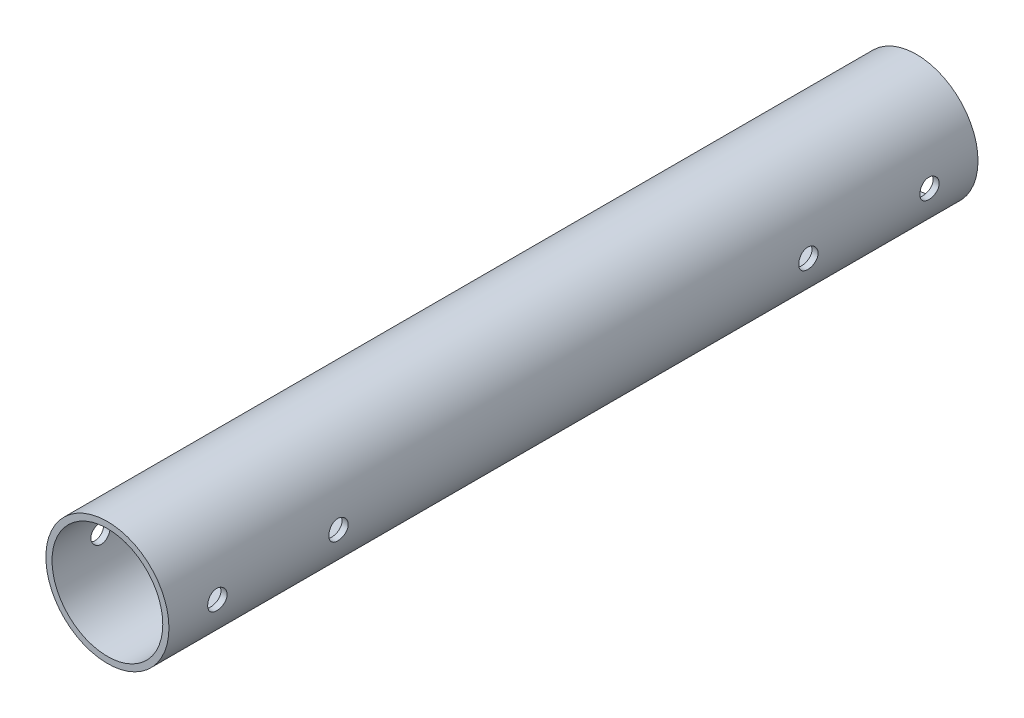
ISO-10303-21;
HEADER;
FILE_DESCRIPTION(('STEP AP214'),'2;1');
FILE_NAME('part.step','',(''),(''),'','','');
FILE_SCHEMA(('AUTOMOTIVE_DESIGN { 1 0 10303 214 1 1 1 1 }'));
ENDSEC;
DATA;
#1=APPLICATION_CONTEXT('core data for automotive mechanical design processes');
#2=APPLICATION_PROTOCOL_DEFINITION('international standard','automotive_design',2000,#1);
#3=PRODUCT_CONTEXT('',#1,'mechanical');
#4=PRODUCT('Part','Part','',(#3));
#5=PRODUCT_RELATED_PRODUCT_CATEGORY('part','',(#4));
#6=PRODUCT_DEFINITION_FORMATION('','',#4);
#7=PRODUCT_DEFINITION_CONTEXT('part definition',#1,'design');
#8=PRODUCT_DEFINITION('design','',#6,#7);
#9=PRODUCT_DEFINITION_SHAPE('','',#8);
#10=(LENGTH_UNIT() NAMED_UNIT(*) SI_UNIT(.MILLI.,.METRE.));
#11=(NAMED_UNIT(*) PLANE_ANGLE_UNIT() SI_UNIT($,.RADIAN.));
#12=(NAMED_UNIT(*) SI_UNIT($,.STERADIAN.) SOLID_ANGLE_UNIT());
#13=UNCERTAINTY_MEASURE_WITH_UNIT(LENGTH_MEASURE(1.E-05),#10,'distance_accuracy_value','');
#14=(GEOMETRIC_REPRESENTATION_CONTEXT(3) GLOBAL_UNCERTAINTY_ASSIGNED_CONTEXT((#13)) GLOBAL_UNIT_ASSIGNED_CONTEXT((#10,
#11,#12)) REPRESENTATION_CONTEXT('',''));
#15=CARTESIAN_POINT('',(0.,0.,0.));
#16=DIRECTION('',(0.,0.,1.));
#17=DIRECTION('',(1.,0.,0.));
#18=AXIS2_PLACEMENT_3D('',#15,#16,#17);
#19=CARTESIAN_POINT('',(0.,0.,167.));
#20=DIRECTION('',(0.,0.,1.));
#21=DIRECTION('',(1.,0.,0.));
#22=AXIS2_PLACEMENT_3D('',#19,#20,#21);
#23=PLANE('',#22);
#24=CARTESIAN_POINT('',(0.,0.,167.));
#25=DIRECTION('',(0.,0.,1.));
#26=DIRECTION('',(1.,0.,0.));
#27=AXIS2_PLACEMENT_3D('',#24,#25,#26);
#28=CIRCLE('',#27,12.7);
#29=CARTESIAN_POINT('',(12.7,0.,167.));
#30=VERTEX_POINT('',#29);
#31=EDGE_CURVE('E10',#30,#30,#28,.T.);
#32=ORIENTED_EDGE('',*,*,#31,.T.);
#33=EDGE_LOOP('',(#32));
#34=FACE_BOUND('',#33,.T.);
#35=CARTESIAN_POINT('',(0.,0.,167.));
#36=DIRECTION('',(0.,0.,1.));
#37=DIRECTION('',(1.,0.,0.));
#38=AXIS2_PLACEMENT_3D('',#35,#36,#37);
#39=CIRCLE('',#38,11.43);
#40=CARTESIAN_POINT('',(11.43,0.,167.));
#41=VERTEX_POINT('',#40);
#42=EDGE_CURVE('E64',#41,#41,#39,.T.);
#43=ORIENTED_EDGE('',*,*,#42,.F.);
#44=EDGE_LOOP('',(#43));
#45=FACE_BOUND('',#44,.T.);
#46=ADVANCED_FACE('F43',(#34,#45),#23,.T.);
#47=CARTESIAN_POINT('',(0.,0.,0.));
#48=DIRECTION('',(0.,0.,1.));
#49=DIRECTION('',(1.,0.,0.));
#50=AXIS2_PLACEMENT_3D('',#47,#48,#49);
#51=PLANE('',#50);
#52=CARTESIAN_POINT('',(0.,0.,0.));
#53=DIRECTION('',(0.,0.,1.));
#54=DIRECTION('',(1.,0.,0.));
#55=AXIS2_PLACEMENT_3D('',#52,#53,#54);
#56=CIRCLE('',#55,12.7);
#57=CARTESIAN_POINT('',(12.7,0.,0.));
#58=VERTEX_POINT('',#57);
#59=EDGE_CURVE('E59',#58,#58,#56,.T.);
#60=ORIENTED_EDGE('',*,*,#59,.F.);
#61=EDGE_LOOP('',(#60));
#62=FACE_BOUND('',#61,.T.);
#63=CARTESIAN_POINT('',(0.,0.,0.));
#64=DIRECTION('',(0.,0.,1.));
#65=DIRECTION('',(1.,0.,0.));
#66=AXIS2_PLACEMENT_3D('',#63,#64,#65);
#67=CIRCLE('',#66,11.43);
#68=CARTESIAN_POINT('',(11.43,0.,0.));
#69=VERTEX_POINT('',#68);
#70=EDGE_CURVE('E66',#69,#69,#67,.T.);
#71=ORIENTED_EDGE('',*,*,#70,.T.);
#72=EDGE_LOOP('',(#71));
#73=FACE_BOUND('',#72,.T.);
#74=ADVANCED_FACE('F224',(#62,#73),#51,.F.);
#75=CARTESIAN_POINT('',(0.,0.,167.));
#76=DIRECTION('',(0.,0.,-1.));
#77=DIRECTION('',(-1.,0.,0.));
#78=AXIS2_PLACEMENT_3D('',#75,#76,#77);
#79=CYLINDRICAL_SURFACE('',#78,12.7);
#80=CARTESIAN_POINT('',(-12.7,0.,8.));
#81=CARTESIAN_POINT('',(-12.6999981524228,0.111600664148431,8.00000454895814));
#82=CARTESIAN_POINT('',(-12.6985135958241,0.223264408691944,8.00937257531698));
#83=CARTESIAN_POINT('',(-12.6927343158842,0.443466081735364,8.04658502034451));
#84=CARTESIAN_POINT('',(-12.688436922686,0.552000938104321,8.07444699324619));
#85=CARTESIAN_POINT('',(-12.6775144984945,0.762726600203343,8.14779024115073));
#86=CARTESIAN_POINT('',(-12.6708912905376,0.864922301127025,8.19325771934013));
#87=CARTESIAN_POINT('',(-12.656047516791,1.06021942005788,8.30048653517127));
#88=CARTESIAN_POINT('',(-12.6478271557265,1.15332200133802,8.36224578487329));
#89=CARTESIAN_POINT('',(-12.6306231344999,1.32860297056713,8.5008689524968));
#90=CARTESIAN_POINT('',(-12.6216341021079,1.41069206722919,8.57784511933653));
#91=CARTESIAN_POINT('',(-12.6039474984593,1.56084506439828,8.74447546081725));
#92=CARTESIAN_POINT('',(-12.5952499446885,1.62890812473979,8.83413039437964));
#93=CARTESIAN_POINT('',(-12.5790789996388,1.74942910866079,9.024179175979));
#94=CARTESIAN_POINT('',(-12.5716125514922,1.80179980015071,9.12462898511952));
#95=CARTESIAN_POINT('',(-12.5588230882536,1.88889181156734,9.33303660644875));
#96=CARTESIAN_POINT('',(-12.5534999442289,1.9236141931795,9.44099396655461));
#97=CARTESIAN_POINT('',(-12.5456529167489,1.97414485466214,9.66040975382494));
#98=CARTESIAN_POINT('',(-12.5431063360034,1.99010658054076,9.77183201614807));
#99=CARTESIAN_POINT('',(-12.5410319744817,2.00313837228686,9.99580028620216));
#100=CARTESIAN_POINT('',(-12.5415040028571,2.00020963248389,10.1083462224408));
#101=CARTESIAN_POINT('',(-12.5453927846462,1.97566884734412,10.3302781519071));
#102=CARTESIAN_POINT('',(-12.5487825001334,1.9542283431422,10.4396836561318));
#103=CARTESIAN_POINT('',(-12.5580824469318,1.893541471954,10.6533247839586));
#104=CARTESIAN_POINT('',(-12.563992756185,1.85429455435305,10.7575602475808));
#105=CARTESIAN_POINT('',(-12.5776975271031,1.75893248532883,10.9584206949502));
#106=CARTESIAN_POINT('',(-12.5855000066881,1.70274529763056,11.0550109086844));
#107=CARTESIAN_POINT('',(-12.6021042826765,1.57514886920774,11.237457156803));
#108=CARTESIAN_POINT('',(-12.6109061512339,1.50373852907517,11.3233124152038));
#109=CARTESIAN_POINT('',(-12.6286366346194,1.34678429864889,11.4828452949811));
#110=CARTESIAN_POINT('',(-12.6375655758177,1.2610930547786,11.5563779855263));
#111=CARTESIAN_POINT('',(-12.6544540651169,1.07851000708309,11.6880414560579));
#112=CARTESIAN_POINT('',(-12.6624136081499,0.981618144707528,11.7461721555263));
#113=CARTESIAN_POINT('',(-12.6764760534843,0.779253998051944,11.8453914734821));
#114=CARTESIAN_POINT('',(-12.6825776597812,0.673775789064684,11.8864682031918));
#115=CARTESIAN_POINT('',(-12.6922261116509,0.457300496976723,11.9502838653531));
#116=CARTESIAN_POINT('',(-12.6957731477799,0.346303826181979,11.9730241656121));
#117=CARTESIAN_POINT('',(-12.6998873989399,0.12319251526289,11.9993271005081));
#118=CARTESIAN_POINT('',(-12.7004855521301,0.0111019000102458,12.0030888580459));
#119=CARTESIAN_POINT('',(-12.6987190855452,-0.212108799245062,11.9918574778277));
#120=CARTESIAN_POINT('',(-12.6963545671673,-0.323228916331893,11.9768649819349));
#121=CARTESIAN_POINT('',(-12.6889475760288,-0.540735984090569,11.9287162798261));
#122=CARTESIAN_POINT('',(-12.6839195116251,-0.647145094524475,11.8956577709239));
#123=CARTESIAN_POINT('',(-12.6717471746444,-0.852910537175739,11.8124189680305));
#124=CARTESIAN_POINT('',(-12.6646027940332,-0.952266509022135,11.7622377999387));
#125=CARTESIAN_POINT('',(-12.6489143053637,-1.14197626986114,11.6457158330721));
#126=CARTESIAN_POINT('',(-12.64035950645,-1.23225209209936,11.5792495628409));
#127=CARTESIAN_POINT('',(-12.6228338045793,-1.40043925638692,11.4322178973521));
#128=CARTESIAN_POINT('',(-12.6138628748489,-1.47834980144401,11.3516515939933));
#129=CARTESIAN_POINT('',(-12.5964170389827,-1.62032529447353,11.1778174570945));
#130=CARTESIAN_POINT('',(-12.5879474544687,-1.68425629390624,11.0844396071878));
#131=CARTESIAN_POINT('',(-12.5725597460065,-1.79552493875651,10.8881532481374));
#132=CARTESIAN_POINT('',(-12.5656415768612,-1.84286306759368,10.785245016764));
#133=CARTESIAN_POINT('',(-12.5541791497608,-1.91939776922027,10.5732076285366));
#134=CARTESIAN_POINT('',(-12.5496258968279,-1.94866316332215,10.4641038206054));
#135=CARTESIAN_POINT('',(-12.5433855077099,-1.98843966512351,10.2424521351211));
#136=CARTESIAN_POINT('',(-12.5416981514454,-1.99895221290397,10.1299045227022));
#137=CARTESIAN_POINT('',(-12.5413893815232,-2.00088776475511,9.90589618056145));
#138=CARTESIAN_POINT('',(-12.5427341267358,-1.99252147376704,9.79443726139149));
#139=CARTESIAN_POINT('',(-12.5482642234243,-1.95739014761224,9.57453327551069));
#140=CARTESIAN_POINT('',(-12.5524495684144,-1.93062515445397,9.46608820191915));
#141=CARTESIAN_POINT('',(-12.5631769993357,-1.8595334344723,9.25535875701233));
#142=CARTESIAN_POINT('',(-12.569716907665,-1.81522293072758,9.15306879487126));
#143=CARTESIAN_POINT('',(-12.5844189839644,-1.71031923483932,8.95734065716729));
#144=CARTESIAN_POINT('',(-12.5925812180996,-1.6497253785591,8.86390284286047));
#145=CARTESIAN_POINT('',(-12.609716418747,-1.51321535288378,8.68746339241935));
#146=CARTESIAN_POINT('',(-12.6186970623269,-1.4371435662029,8.60458288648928));
#147=CARTESIAN_POINT('',(-12.6363943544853,-1.27216585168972,8.45269006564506));
#148=CARTESIAN_POINT('',(-12.645110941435,-1.18325695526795,8.38368096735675));
#149=CARTESIAN_POINT('',(-12.6613592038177,-0.994487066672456,8.26110942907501));
#150=CARTESIAN_POINT('',(-12.6688833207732,-0.894562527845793,8.20764385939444));
#151=CARTESIAN_POINT('',(-12.6818250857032,-0.687076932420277,8.11833699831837));
#152=CARTESIAN_POINT('',(-12.6872448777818,-0.579523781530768,8.08247775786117));
#153=CARTESIAN_POINT('',(-12.6941538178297,-0.392929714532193,8.03738375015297));
#154=CARTESIAN_POINT('',(-12.6963346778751,-0.3150309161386,8.02338671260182));
#155=CARTESIAN_POINT('',(-12.699258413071,-0.158098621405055,8.00469329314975));
#156=CARTESIAN_POINT('',(-12.7000013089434,-0.0790651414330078,7.99999677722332));
#157=CARTESIAN_POINT('',(-12.7,0.,8.));
#158=B_SPLINE_CURVE_WITH_KNOTS('',3,(#80,#81,#82,#83,#84,#85,#86,#87,#88,#89,#90,#91,#92,#93,
#94,#95,#96,#97,#98,#99,#100,#101,#102,#103,#104,#105,#106,#107,#108,#109,#110,#111,#112,#113,
#114,#115,#116,#117,#118,#119,#120,#121,#122,#123,#124,#125,#126,#127,#128,#129,#130,#131,#132,
#133,#134,#135,#136,#137,#138,#139,#140,#141,#142,#143,#144,#145,#146,#147,#148,#149,#150,#151,
#152,#153,#154,#155,#156,#157),.UNSPECIFIED.,.T.,.F.,(4,2,2,2,2,2,2,2,2,2,2,2,2,2,2,2,2,2,2,2,2,
2,2,2,2,2,2,2,2,2,2,2,2,2,2,2,2,2,4),(0.,0.334513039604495,0.669344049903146,1.00391319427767,
1.33843948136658,1.67553227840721,2.0126452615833,2.35159886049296,2.69053206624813,
3.02667336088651,3.36279340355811,3.69583178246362,4.02888046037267,4.36336585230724,
4.69787540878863,5.03607855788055,5.37428347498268,5.71272376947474,6.05113881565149,
6.38599571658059,6.72084115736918,7.05389348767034,7.38696282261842,7.72268383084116,
8.05842646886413,8.39725738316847,8.73607842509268,9.07360114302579,9.41109794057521,
9.74484662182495,10.0785945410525,10.4120345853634,10.7454882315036,11.0824767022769,
11.4195432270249,11.758667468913,12.0974452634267,12.3344393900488,12.5714301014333),.UNSPECIFIED.);
#159=CARTESIAN_POINT('',(-12.7,0.,8.));
#160=VERTEX_POINT('',#159);
#161=EDGE_CURVE('E156',#160,#160,#158,.T.);
#162=ORIENTED_EDGE('',*,*,#161,.T.);
#163=EDGE_LOOP('',(#162));
#164=FACE_BOUND('',#163,.T.);
#165=CARTESIAN_POINT('',(12.7,0.,8.));
#166=CARTESIAN_POINT('',(12.6999981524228,-0.111600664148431,8.00000454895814));
#167=CARTESIAN_POINT('',(12.6985135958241,-0.223264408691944,8.00937257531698));
#168=CARTESIAN_POINT('',(12.6927343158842,-0.443466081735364,8.04658502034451));
#169=CARTESIAN_POINT('',(12.688436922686,-0.552000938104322,8.07444699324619));
#170=CARTESIAN_POINT('',(12.6775144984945,-0.762726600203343,8.14779024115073));
#171=CARTESIAN_POINT('',(12.6708912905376,-0.864922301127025,8.19325771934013));
#172=CARTESIAN_POINT('',(12.656047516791,-1.06021942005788,8.30048653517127));
#173=CARTESIAN_POINT('',(12.6478271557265,-1.15332200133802,8.36224578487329));
#174=CARTESIAN_POINT('',(12.6306231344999,-1.32860297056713,8.5008689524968));
#175=CARTESIAN_POINT('',(12.6216341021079,-1.41069206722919,8.57784511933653));
#176=CARTESIAN_POINT('',(12.6039474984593,-1.56084506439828,8.74447546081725));
#177=CARTESIAN_POINT('',(12.5952499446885,-1.62890812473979,8.83413039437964));
#178=CARTESIAN_POINT('',(12.5790789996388,-1.74942910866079,9.024179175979));
#179=CARTESIAN_POINT('',(12.5716125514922,-1.80179980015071,9.12462898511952));
#180=CARTESIAN_POINT('',(12.5588230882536,-1.88889181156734,9.33303660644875));
#181=CARTESIAN_POINT('',(12.5534999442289,-1.9236141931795,9.44099396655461));
#182=CARTESIAN_POINT('',(12.5456529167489,-1.97414485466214,9.66040975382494));
#183=CARTESIAN_POINT('',(12.5431063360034,-1.99010658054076,9.77183201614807));
#184=CARTESIAN_POINT('',(12.5410319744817,-2.00313837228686,9.99580028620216));
#185=CARTESIAN_POINT('',(12.5415040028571,-2.00020963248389,10.1083462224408));
#186=CARTESIAN_POINT('',(12.5453927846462,-1.97566884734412,10.3302781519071));
#187=CARTESIAN_POINT('',(12.5487825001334,-1.9542283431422,10.4396836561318));
#188=CARTESIAN_POINT('',(12.5580824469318,-1.893541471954,10.6533247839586));
#189=CARTESIAN_POINT('',(12.563992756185,-1.85429455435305,10.7575602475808));
#190=CARTESIAN_POINT('',(12.5776975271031,-1.75893248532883,10.9584206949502));
#191=CARTESIAN_POINT('',(12.5855000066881,-1.70274529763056,11.0550109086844));
#192=CARTESIAN_POINT('',(12.6021042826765,-1.57514886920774,11.237457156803));
#193=CARTESIAN_POINT('',(12.6109061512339,-1.50373852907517,11.3233124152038));
#194=CARTESIAN_POINT('',(12.6286366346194,-1.34678429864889,11.4828452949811));
#195=CARTESIAN_POINT('',(12.6375655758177,-1.2610930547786,11.5563779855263));
#196=CARTESIAN_POINT('',(12.6544540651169,-1.07851000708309,11.6880414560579));
#197=CARTESIAN_POINT('',(12.6624136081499,-0.981618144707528,11.7461721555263));
#198=CARTESIAN_POINT('',(12.6764760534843,-0.779253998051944,11.8453914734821));
#199=CARTESIAN_POINT('',(12.6825776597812,-0.673775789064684,11.8864682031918));
#200=CARTESIAN_POINT('',(12.6922261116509,-0.457300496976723,11.9502838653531));
#201=CARTESIAN_POINT('',(12.6957731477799,-0.346303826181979,11.9730241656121));
#202=CARTESIAN_POINT('',(12.6998873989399,-0.12319251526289,11.9993271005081));
#203=CARTESIAN_POINT('',(12.7004855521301,-0.0111019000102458,12.0030888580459));
#204=CARTESIAN_POINT('',(12.6987190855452,0.212108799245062,11.9918574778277));
#205=CARTESIAN_POINT('',(12.6963545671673,0.323228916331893,11.9768649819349));
#206=CARTESIAN_POINT('',(12.6889475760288,0.540735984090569,11.9287162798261));
#207=CARTESIAN_POINT('',(12.6839195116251,0.647145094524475,11.8956577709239));
#208=CARTESIAN_POINT('',(12.6717471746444,0.852910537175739,11.8124189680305));
#209=CARTESIAN_POINT('',(12.6646027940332,0.952266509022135,11.7622377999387));
#210=CARTESIAN_POINT('',(12.6489143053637,1.14197626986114,11.6457158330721));
#211=CARTESIAN_POINT('',(12.64035950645,1.23225209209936,11.5792495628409));
#212=CARTESIAN_POINT('',(12.6228338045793,1.40043925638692,11.4322178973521));
#213=CARTESIAN_POINT('',(12.6138628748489,1.47834980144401,11.3516515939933));
#214=CARTESIAN_POINT('',(12.5964170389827,1.62032529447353,11.1778174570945));
#215=CARTESIAN_POINT('',(12.5879474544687,1.68425629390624,11.0844396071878));
#216=CARTESIAN_POINT('',(12.5725597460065,1.79552493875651,10.8881532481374));
#217=CARTESIAN_POINT('',(12.5656415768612,1.84286306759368,10.785245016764));
#218=CARTESIAN_POINT('',(12.5541791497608,1.91939776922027,10.5732076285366));
#219=CARTESIAN_POINT('',(12.5496258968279,1.94866316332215,10.4641038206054));
#220=CARTESIAN_POINT('',(12.5433855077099,1.98843966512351,10.2424521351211));
#221=CARTESIAN_POINT('',(12.5416981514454,1.99895221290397,10.1299045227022));
#222=CARTESIAN_POINT('',(12.5413893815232,2.00088776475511,9.90589618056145));
#223=CARTESIAN_POINT('',(12.5427341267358,1.99252147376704,9.79443726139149));
#224=CARTESIAN_POINT('',(12.5482642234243,1.95739014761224,9.57453327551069));
#225=CARTESIAN_POINT('',(12.5524495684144,1.93062515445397,9.46608820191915));
#226=CARTESIAN_POINT('',(12.5631769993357,1.8595334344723,9.25535875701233));
#227=CARTESIAN_POINT('',(12.569716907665,1.81522293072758,9.15306879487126));
#228=CARTESIAN_POINT('',(12.5844189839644,1.71031923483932,8.95734065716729));
#229=CARTESIAN_POINT('',(12.5925812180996,1.6497253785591,8.86390284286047));
#230=CARTESIAN_POINT('',(12.609716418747,1.51321535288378,8.68746339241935));
#231=CARTESIAN_POINT('',(12.6186970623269,1.4371435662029,8.60458288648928));
#232=CARTESIAN_POINT('',(12.6363943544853,1.27216585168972,8.45269006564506));
#233=CARTESIAN_POINT('',(12.645110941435,1.18325695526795,8.38368096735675));
#234=CARTESIAN_POINT('',(12.6613592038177,0.994487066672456,8.26110942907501));
#235=CARTESIAN_POINT('',(12.6688833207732,0.894562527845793,8.20764385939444));
#236=CARTESIAN_POINT('',(12.6818250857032,0.687076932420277,8.11833699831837));
#237=CARTESIAN_POINT('',(12.6872448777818,0.579523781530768,8.08247775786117));
#238=CARTESIAN_POINT('',(12.6941538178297,0.392929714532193,8.03738375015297));
#239=CARTESIAN_POINT('',(12.6963346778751,0.3150309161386,8.02338671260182));
#240=CARTESIAN_POINT('',(12.699258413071,0.158098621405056,8.00469329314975));
#241=CARTESIAN_POINT('',(12.7000013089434,0.0790651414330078,7.99999677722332));
#242=CARTESIAN_POINT('',(12.7,0.,8.));
#243=B_SPLINE_CURVE_WITH_KNOTS('',3,(#165,#166,#167,#168,#169,#170,#171,#172,#173,#174,#175,
#176,#177,#178,#179,#180,#181,#182,#183,#184,#185,#186,#187,#188,#189,#190,#191,#192,#193,#194,
#195,#196,#197,#198,#199,#200,#201,#202,#203,#204,#205,#206,#207,#208,#209,#210,#211,#212,#213,
#214,#215,#216,#217,#218,#219,#220,#221,#222,#223,#224,#225,#226,#227,#228,#229,#230,#231,#232,
#233,#234,#235,#236,#237,#238,#239,#240,#241,#242),.UNSPECIFIED.,.T.,.F.,(4,2,2,2,2,2,2,2,2,2,2,
2,2,2,2,2,2,2,2,2,2,2,2,2,2,2,2,2,2,2,2,2,2,2,2,2,2,2,4),(0.,0.334513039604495,
0.669344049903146,1.00391319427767,1.33843948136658,1.67553227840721,2.0126452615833,
2.35159886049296,2.69053206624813,3.02667336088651,3.36279340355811,3.69583178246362,
4.02888046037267,4.36336585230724,4.69787540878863,5.03607855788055,5.37428347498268,
5.71272376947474,6.05113881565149,6.38599571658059,6.72084115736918,7.05389348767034,
7.38696282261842,7.72268383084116,8.05842646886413,8.39725738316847,8.73607842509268,
9.07360114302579,9.41109794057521,9.74484662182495,10.0785945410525,10.4120345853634,
10.7454882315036,11.0824767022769,11.4195432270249,11.758667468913,12.0974452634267,
12.3344393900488,12.5714301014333),.UNSPECIFIED.);
#244=CARTESIAN_POINT('',(12.7,0.,8.));
#245=VERTEX_POINT('',#244);
#246=EDGE_CURVE('E149',#245,#245,#243,.T.);
#247=ORIENTED_EDGE('',*,*,#246,.T.);
#248=EDGE_LOOP('',(#247));
#249=FACE_BOUND('',#248,.T.);
#250=CARTESIAN_POINT('',(-12.7,0.,130.));
#251=CARTESIAN_POINT('',(-12.6999981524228,0.11160066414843,130.000004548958));
#252=CARTESIAN_POINT('',(-12.6985135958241,0.223264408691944,130.009372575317));
#253=CARTESIAN_POINT('',(-12.6927343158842,0.443466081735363,130.046585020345));
#254=CARTESIAN_POINT('',(-12.688436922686,0.552000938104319,130.074446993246));
#255=CARTESIAN_POINT('',(-12.6775144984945,0.762726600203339,130.147790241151));
#256=CARTESIAN_POINT('',(-12.6708912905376,0.86492230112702,130.19325771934));
#257=CARTESIAN_POINT('',(-12.656047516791,1.06021942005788,130.300486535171));
#258=CARTESIAN_POINT('',(-12.6478271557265,1.15332200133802,130.362245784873));
#259=CARTESIAN_POINT('',(-12.6306231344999,1.32860297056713,130.500868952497));
#260=CARTESIAN_POINT('',(-12.6216341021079,1.4106920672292,130.577845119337));
#261=CARTESIAN_POINT('',(-12.6039474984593,1.56084506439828,130.744475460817));
#262=CARTESIAN_POINT('',(-12.5952499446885,1.6289081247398,130.83413039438));
#263=CARTESIAN_POINT('',(-12.5790789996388,1.74942910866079,131.024179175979));
#264=CARTESIAN_POINT('',(-12.5716125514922,1.80179980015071,131.12462898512));
#265=CARTESIAN_POINT('',(-12.5588230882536,1.88889181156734,131.333036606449));
#266=CARTESIAN_POINT('',(-12.5534999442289,1.9236141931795,131.440993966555));
#267=CARTESIAN_POINT('',(-12.5456529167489,1.97414485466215,131.660409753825));
#268=CARTESIAN_POINT('',(-12.5431063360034,1.99010658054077,131.771832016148));
#269=CARTESIAN_POINT('',(-12.5410319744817,2.00313837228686,131.995800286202));
#270=CARTESIAN_POINT('',(-12.5415040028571,2.00020963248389,132.108346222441));
#271=CARTESIAN_POINT('',(-12.5453927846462,1.97566884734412,132.330278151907));
#272=CARTESIAN_POINT('',(-12.5487825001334,1.9542283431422,132.439683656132));
#273=CARTESIAN_POINT('',(-12.5580824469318,1.89354147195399,132.653324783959));
#274=CARTESIAN_POINT('',(-12.563992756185,1.85429455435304,132.757560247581));
#275=CARTESIAN_POINT('',(-12.5776975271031,1.75893248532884,132.95842069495));
#276=CARTESIAN_POINT('',(-12.5855000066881,1.70274529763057,133.055010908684));
#277=CARTESIAN_POINT('',(-12.6021042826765,1.57514886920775,133.237457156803));
#278=CARTESIAN_POINT('',(-12.6109061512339,1.50373852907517,133.323312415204));
#279=CARTESIAN_POINT('',(-12.6286366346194,1.34678429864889,133.482845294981));
#280=CARTESIAN_POINT('',(-12.6375655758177,1.2610930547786,133.556377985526));
#281=CARTESIAN_POINT('',(-12.6544540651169,1.07851000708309,133.688041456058));
#282=CARTESIAN_POINT('',(-12.6624136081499,0.98161814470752,133.746172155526));
#283=CARTESIAN_POINT('',(-12.6764760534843,0.779253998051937,133.845391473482));
#284=CARTESIAN_POINT('',(-12.6825776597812,0.67377578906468,133.886468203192));
#285=CARTESIAN_POINT('',(-12.6922261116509,0.457300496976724,133.950283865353));
#286=CARTESIAN_POINT('',(-12.6957731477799,0.346303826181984,133.973024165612));
#287=CARTESIAN_POINT('',(-12.6998873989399,0.123192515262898,133.999327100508));
#288=CARTESIAN_POINT('',(-12.7004855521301,0.0111019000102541,134.003088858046));
#289=CARTESIAN_POINT('',(-12.6987190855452,-0.212108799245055,133.991857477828));
#290=CARTESIAN_POINT('',(-12.6963545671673,-0.323228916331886,133.976864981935));
#291=CARTESIAN_POINT('',(-12.6889475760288,-0.540735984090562,133.928716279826));
#292=CARTESIAN_POINT('',(-12.6839195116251,-0.647145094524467,133.895657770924));
#293=CARTESIAN_POINT('',(-12.6717471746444,-0.852910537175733,133.81241896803));
#294=CARTESIAN_POINT('',(-12.6646027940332,-0.952266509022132,133.762237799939));
#295=CARTESIAN_POINT('',(-12.6489143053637,-1.14197626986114,133.645715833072));
#296=CARTESIAN_POINT('',(-12.64035950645,-1.23225209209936,133.579249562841));
#297=CARTESIAN_POINT('',(-12.6228338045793,-1.40043925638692,133.432217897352));
#298=CARTESIAN_POINT('',(-12.6138628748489,-1.47834980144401,133.351651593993));
#299=CARTESIAN_POINT('',(-12.5964170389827,-1.62032529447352,133.177817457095));
#300=CARTESIAN_POINT('',(-12.5879474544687,-1.68425629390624,133.084439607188));
#301=CARTESIAN_POINT('',(-12.5725597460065,-1.79552493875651,132.888153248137));
#302=CARTESIAN_POINT('',(-12.5656415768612,-1.84286306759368,132.785245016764));
#303=CARTESIAN_POINT('',(-12.5541791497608,-1.91939776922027,132.573207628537));
#304=CARTESIAN_POINT('',(-12.5496258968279,-1.94866316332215,132.464103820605));
#305=CARTESIAN_POINT('',(-12.5433855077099,-1.98843966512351,132.242452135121));
#306=CARTESIAN_POINT('',(-12.5416981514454,-1.99895221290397,132.129904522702));
#307=CARTESIAN_POINT('',(-12.5413893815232,-2.00088776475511,131.905896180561));
#308=CARTESIAN_POINT('',(-12.5427341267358,-1.99252147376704,131.794437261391));
#309=CARTESIAN_POINT('',(-12.5482642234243,-1.95739014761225,131.574533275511));
#310=CARTESIAN_POINT('',(-12.5524495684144,-1.93062515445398,131.466088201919));
#311=CARTESIAN_POINT('',(-12.5631769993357,-1.8595334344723,131.255358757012));
#312=CARTESIAN_POINT('',(-12.569716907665,-1.81522293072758,131.153068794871));
#313=CARTESIAN_POINT('',(-12.5844189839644,-1.71031923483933,130.957340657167));
#314=CARTESIAN_POINT('',(-12.5925812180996,-1.64972537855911,130.863902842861));
#315=CARTESIAN_POINT('',(-12.609716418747,-1.51321535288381,130.687463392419));
#316=CARTESIAN_POINT('',(-12.6186970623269,-1.43714356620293,130.604582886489));
#317=CARTESIAN_POINT('',(-12.6363943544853,-1.27216585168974,130.452690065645));
#318=CARTESIAN_POINT('',(-12.645110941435,-1.18325695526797,130.383680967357));
#319=CARTESIAN_POINT('',(-12.6613592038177,-0.994487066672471,130.261109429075));
#320=CARTESIAN_POINT('',(-12.6688833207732,-0.894562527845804,130.207643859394));
#321=CARTESIAN_POINT('',(-12.6818250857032,-0.687076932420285,130.118336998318));
#322=CARTESIAN_POINT('',(-12.6872448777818,-0.579523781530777,130.082477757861));
#323=CARTESIAN_POINT('',(-12.6941538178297,-0.3929297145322,130.037383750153));
#324=CARTESIAN_POINT('',(-12.6963346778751,-0.315030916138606,130.023386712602));
#325=CARTESIAN_POINT('',(-12.699258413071,-0.158098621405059,130.00469329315));
#326=CARTESIAN_POINT('',(-12.7000013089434,-0.0790651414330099,129.999996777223));
#327=CARTESIAN_POINT('',(-12.7,0.,130.));
#328=B_SPLINE_CURVE_WITH_KNOTS('',3,(#250,#251,#252,#253,#254,#255,#256,#257,#258,#259,#260,
#261,#262,#263,#264,#265,#266,#267,#268,#269,#270,#271,#272,#273,#274,#275,#276,#277,#278,#279,
#280,#281,#282,#283,#284,#285,#286,#287,#288,#289,#290,#291,#292,#293,#294,#295,#296,#297,#298,
#299,#300,#301,#302,#303,#304,#305,#306,#307,#308,#309,#310,#311,#312,#313,#314,#315,#316,#317,
#318,#319,#320,#321,#322,#323,#324,#325,#326,#327),.UNSPECIFIED.,.T.,.F.,(4,2,2,2,2,2,2,2,2,2,2,
2,2,2,2,2,2,2,2,2,2,2,2,2,2,2,2,2,2,2,2,2,2,2,2,2,2,2,4),(0.,0.334513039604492,
0.669344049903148,1.00391319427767,1.33843948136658,1.67553227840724,2.0126452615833,
2.35159886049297,2.69053206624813,3.02667336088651,3.36279340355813,3.69583178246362,
4.02888046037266,4.36336585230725,4.69787540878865,5.03607855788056,5.37428347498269,
5.71272376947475,6.05113881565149,6.38599571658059,6.72084115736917,7.05389348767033,
7.38696282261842,7.72268383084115,8.05842646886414,8.39725738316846,8.73607842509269,
9.07360114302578,9.41109794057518,9.74484662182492,10.0785945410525,10.4120345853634,
10.7454882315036,11.0824767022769,11.4195432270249,11.758667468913,12.0974452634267,
12.3344393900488,12.5714301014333),.UNSPECIFIED.);
#329=CARTESIAN_POINT('',(-12.7,0.,130.));
#330=VERTEX_POINT('',#329);
#331=EDGE_CURVE('E137',#330,#330,#328,.T.);
#332=ORIENTED_EDGE('',*,*,#331,.T.);
#333=EDGE_LOOP('',(#332));
#334=FACE_BOUND('',#333,.T.);
#335=CARTESIAN_POINT('',(12.7,0.,130.));
#336=CARTESIAN_POINT('',(12.6999981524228,-0.11160066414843,130.000004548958));
#337=CARTESIAN_POINT('',(12.6985135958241,-0.223264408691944,130.009372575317));
#338=CARTESIAN_POINT('',(12.6927343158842,-0.443466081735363,130.046585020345));
#339=CARTESIAN_POINT('',(12.688436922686,-0.552000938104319,130.074446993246));
#340=CARTESIAN_POINT('',(12.6775144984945,-0.762726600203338,130.147790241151));
#341=CARTESIAN_POINT('',(12.6708912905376,-0.86492230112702,130.19325771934));
#342=CARTESIAN_POINT('',(12.656047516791,-1.06021942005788,130.300486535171));
#343=CARTESIAN_POINT('',(12.6478271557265,-1.15332200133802,130.362245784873));
#344=CARTESIAN_POINT('',(12.6306231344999,-1.32860297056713,130.500868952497));
#345=CARTESIAN_POINT('',(12.6216341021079,-1.4106920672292,130.577845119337));
#346=CARTESIAN_POINT('',(12.6039474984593,-1.56084506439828,130.744475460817));
#347=CARTESIAN_POINT('',(12.5952499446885,-1.6289081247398,130.83413039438));
#348=CARTESIAN_POINT('',(12.5790789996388,-1.74942910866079,131.024179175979));
#349=CARTESIAN_POINT('',(12.5716125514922,-1.80179980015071,131.12462898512));
#350=CARTESIAN_POINT('',(12.5588230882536,-1.88889181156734,131.333036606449));
#351=CARTESIAN_POINT('',(12.5534999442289,-1.9236141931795,131.440993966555));
#352=CARTESIAN_POINT('',(12.5456529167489,-1.97414485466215,131.660409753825));
#353=CARTESIAN_POINT('',(12.5431063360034,-1.99010658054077,131.771832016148));
#354=CARTESIAN_POINT('',(12.5410319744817,-2.00313837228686,131.995800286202));
#355=CARTESIAN_POINT('',(12.5415040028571,-2.00020963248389,132.108346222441));
#356=CARTESIAN_POINT('',(12.5453927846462,-1.97566884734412,132.330278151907));
#357=CARTESIAN_POINT('',(12.5487825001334,-1.9542283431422,132.439683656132));
#358=CARTESIAN_POINT('',(12.5580824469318,-1.89354147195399,132.653324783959));
#359=CARTESIAN_POINT('',(12.563992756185,-1.85429455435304,132.757560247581));
#360=CARTESIAN_POINT('',(12.5776975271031,-1.75893248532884,132.95842069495));
#361=CARTESIAN_POINT('',(12.5855000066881,-1.70274529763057,133.055010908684));
#362=CARTESIAN_POINT('',(12.6021042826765,-1.57514886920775,133.237457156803));
#363=CARTESIAN_POINT('',(12.6109061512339,-1.50373852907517,133.323312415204));
#364=CARTESIAN_POINT('',(12.6286366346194,-1.34678429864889,133.482845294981));
#365=CARTESIAN_POINT('',(12.6375655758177,-1.2610930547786,133.556377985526));
#366=CARTESIAN_POINT('',(12.6544540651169,-1.07851000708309,133.688041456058));
#367=CARTESIAN_POINT('',(12.6624136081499,-0.98161814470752,133.746172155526));
#368=CARTESIAN_POINT('',(12.6764760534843,-0.779253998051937,133.845391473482));
#369=CARTESIAN_POINT('',(12.6825776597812,-0.67377578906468,133.886468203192));
#370=CARTESIAN_POINT('',(12.6922261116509,-0.457300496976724,133.950283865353));
#371=CARTESIAN_POINT('',(12.6957731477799,-0.346303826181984,133.973024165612));
#372=CARTESIAN_POINT('',(12.6998873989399,-0.123192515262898,133.999327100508));
#373=CARTESIAN_POINT('',(12.7004855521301,-0.0111019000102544,134.003088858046));
#374=CARTESIAN_POINT('',(12.6987190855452,0.212108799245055,133.991857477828));
#375=CARTESIAN_POINT('',(12.6963545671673,0.323228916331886,133.976864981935));
#376=CARTESIAN_POINT('',(12.6889475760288,0.540735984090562,133.928716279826));
#377=CARTESIAN_POINT('',(12.6839195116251,0.647145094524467,133.895657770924));
#378=CARTESIAN_POINT('',(12.6717471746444,0.852910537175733,133.81241896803));
#379=CARTESIAN_POINT('',(12.6646027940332,0.952266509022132,133.762237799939));
#380=CARTESIAN_POINT('',(12.6489143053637,1.14197626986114,133.645715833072));
#381=CARTESIAN_POINT('',(12.64035950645,1.23225209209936,133.579249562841));
#382=CARTESIAN_POINT('',(12.6228338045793,1.40043925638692,133.432217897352));
#383=CARTESIAN_POINT('',(12.6138628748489,1.47834980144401,133.351651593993));
#384=CARTESIAN_POINT('',(12.5964170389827,1.62032529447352,133.177817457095));
#385=CARTESIAN_POINT('',(12.5879474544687,1.68425629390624,133.084439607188));
#386=CARTESIAN_POINT('',(12.5725597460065,1.79552493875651,132.888153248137));
#387=CARTESIAN_POINT('',(12.5656415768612,1.84286306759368,132.785245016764));
#388=CARTESIAN_POINT('',(12.5541791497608,1.91939776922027,132.573207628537));
#389=CARTESIAN_POINT('',(12.5496258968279,1.94866316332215,132.464103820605));
#390=CARTESIAN_POINT('',(12.5433855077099,1.98843966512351,132.242452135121));
#391=CARTESIAN_POINT('',(12.5416981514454,1.99895221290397,132.129904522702));
#392=CARTESIAN_POINT('',(12.5413893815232,2.00088776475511,131.905896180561));
#393=CARTESIAN_POINT('',(12.5427341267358,1.99252147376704,131.794437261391));
#394=CARTESIAN_POINT('',(12.5482642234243,1.95739014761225,131.574533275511));
#395=CARTESIAN_POINT('',(12.5524495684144,1.93062515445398,131.466088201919));
#396=CARTESIAN_POINT('',(12.5631769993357,1.8595334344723,131.255358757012));
#397=CARTESIAN_POINT('',(12.569716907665,1.81522293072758,131.153068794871));
#398=CARTESIAN_POINT('',(12.5844189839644,1.71031923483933,130.957340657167));
#399=CARTESIAN_POINT('',(12.5925812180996,1.64972537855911,130.863902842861));
#400=CARTESIAN_POINT('',(12.609716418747,1.51321535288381,130.687463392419));
#401=CARTESIAN_POINT('',(12.6186970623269,1.43714356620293,130.604582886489));
#402=CARTESIAN_POINT('',(12.6363943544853,1.27216585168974,130.452690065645));
#403=CARTESIAN_POINT('',(12.645110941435,1.18325695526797,130.383680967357));
#404=CARTESIAN_POINT('',(12.6613592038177,0.994487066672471,130.261109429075));
#405=CARTESIAN_POINT('',(12.6688833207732,0.894562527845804,130.207643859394));
#406=CARTESIAN_POINT('',(12.6818250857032,0.687076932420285,130.118336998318));
#407=CARTESIAN_POINT('',(12.6872448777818,0.579523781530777,130.082477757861));
#408=CARTESIAN_POINT('',(12.6941538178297,0.3929297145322,130.037383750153));
#409=CARTESIAN_POINT('',(12.6963346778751,0.315030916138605,130.023386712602));
#410=CARTESIAN_POINT('',(12.699258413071,0.158098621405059,130.00469329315));
#411=CARTESIAN_POINT('',(12.7000013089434,0.0790651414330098,129.999996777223));
#412=CARTESIAN_POINT('',(12.7,0.,130.));
#413=B_SPLINE_CURVE_WITH_KNOTS('',3,(#335,#336,#337,#338,#339,#340,#341,#342,#343,#344,#345,
#346,#347,#348,#349,#350,#351,#352,#353,#354,#355,#356,#357,#358,#359,#360,#361,#362,#363,#364,
#365,#366,#367,#368,#369,#370,#371,#372,#373,#374,#375,#376,#377,#378,#379,#380,#381,#382,#383,
#384,#385,#386,#387,#388,#389,#390,#391,#392,#393,#394,#395,#396,#397,#398,#399,#400,#401,#402,
#403,#404,#405,#406,#407,#408,#409,#410,#411,#412),.UNSPECIFIED.,.T.,.F.,(4,2,2,2,2,2,2,2,2,2,2,
2,2,2,2,2,2,2,2,2,2,2,2,2,2,2,2,2,2,2,2,2,2,2,2,2,2,2,4),(0.,0.334513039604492,
0.669344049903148,1.00391319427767,1.33843948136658,1.67553227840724,2.0126452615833,
2.35159886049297,2.69053206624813,3.02667336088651,3.36279340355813,3.69583178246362,
4.02888046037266,4.36336585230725,4.69787540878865,5.03607855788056,5.37428347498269,
5.71272376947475,6.05113881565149,6.38599571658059,6.72084115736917,7.05389348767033,
7.38696282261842,7.72268383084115,8.05842646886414,8.39725738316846,8.73607842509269,
9.07360114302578,9.41109794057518,9.74484662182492,10.0785945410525,10.4120345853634,
10.7454882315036,11.0824767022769,11.4195432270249,11.758667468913,12.0974452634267,
12.3344393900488,12.5714301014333),.UNSPECIFIED.);
#414=CARTESIAN_POINT('',(12.7,0.,130.));
#415=VERTEX_POINT('',#414);
#416=EDGE_CURVE('E131',#415,#415,#413,.T.);
#417=ORIENTED_EDGE('',*,*,#416,.T.);
#418=EDGE_LOOP('',(#417));
#419=FACE_BOUND('',#418,.T.);
#420=CARTESIAN_POINT('',(-12.7,0.,155.));
#421=CARTESIAN_POINT('',(-12.6999981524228,0.11160066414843,155.000004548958));
#422=CARTESIAN_POINT('',(-12.6985135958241,0.223264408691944,155.009372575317));
#423=CARTESIAN_POINT('',(-12.6927343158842,0.443466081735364,155.046585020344));
#424=CARTESIAN_POINT('',(-12.688436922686,0.55200093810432,155.074446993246));
#425=CARTESIAN_POINT('',(-12.6775144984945,0.762726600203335,155.147790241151));
#426=CARTESIAN_POINT('',(-12.6708912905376,0.864922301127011,155.19325771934));
#427=CARTESIAN_POINT('',(-12.656047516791,1.06021942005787,155.300486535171));
#428=CARTESIAN_POINT('',(-12.6478271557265,1.15332200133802,155.362245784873));
#429=CARTESIAN_POINT('',(-12.6306231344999,1.32860297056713,155.500868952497));
#430=CARTESIAN_POINT('',(-12.6216341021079,1.41069206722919,155.577845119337));
#431=CARTESIAN_POINT('',(-12.6039474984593,1.56084506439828,155.744475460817));
#432=CARTESIAN_POINT('',(-12.5952499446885,1.62890812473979,155.83413039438));
#433=CARTESIAN_POINT('',(-12.5790789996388,1.74942910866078,156.024179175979));
#434=CARTESIAN_POINT('',(-12.5716125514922,1.80179980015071,156.12462898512));
#435=CARTESIAN_POINT('',(-12.5588230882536,1.88889181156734,156.333036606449));
#436=CARTESIAN_POINT('',(-12.5534999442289,1.9236141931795,156.440993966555));
#437=CARTESIAN_POINT('',(-12.5456529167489,1.97414485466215,156.660409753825));
#438=CARTESIAN_POINT('',(-12.5431063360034,1.99010658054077,156.771832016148));
#439=CARTESIAN_POINT('',(-12.5410319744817,2.00313837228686,156.995800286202));
#440=CARTESIAN_POINT('',(-12.5415040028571,2.00020963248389,157.108346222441));
#441=CARTESIAN_POINT('',(-12.5453927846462,1.97566884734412,157.330278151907));
#442=CARTESIAN_POINT('',(-12.5487825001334,1.9542283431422,157.439683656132));
#443=CARTESIAN_POINT('',(-12.5580824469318,1.893541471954,157.653324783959));
#444=CARTESIAN_POINT('',(-12.563992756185,1.85429455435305,157.757560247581));
#445=CARTESIAN_POINT('',(-12.5776975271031,1.75893248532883,157.95842069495));
#446=CARTESIAN_POINT('',(-12.5855000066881,1.70274529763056,158.055010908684));
#447=CARTESIAN_POINT('',(-12.6021042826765,1.57514886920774,158.237457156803));
#448=CARTESIAN_POINT('',(-12.6109061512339,1.50373852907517,158.323312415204));
#449=CARTESIAN_POINT('',(-12.6286366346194,1.3467842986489,158.482845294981));
#450=CARTESIAN_POINT('',(-12.6375655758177,1.2610930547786,158.556377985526));
#451=CARTESIAN_POINT('',(-12.6544540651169,1.07851000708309,158.688041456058));
#452=CARTESIAN_POINT('',(-12.6624136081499,0.981618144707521,158.746172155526));
#453=CARTESIAN_POINT('',(-12.6764760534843,0.779253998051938,158.845391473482));
#454=CARTESIAN_POINT('',(-12.6825776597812,0.673775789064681,158.886468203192));
#455=CARTESIAN_POINT('',(-12.6922261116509,0.457300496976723,158.950283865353));
#456=CARTESIAN_POINT('',(-12.6957731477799,0.346303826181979,158.973024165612));
#457=CARTESIAN_POINT('',(-12.6998873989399,0.123192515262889,158.999327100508));
#458=CARTESIAN_POINT('',(-12.7004855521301,0.0111019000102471,159.003088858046));
#459=CARTESIAN_POINT('',(-12.6987190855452,-0.21210879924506,158.991857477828));
#460=CARTESIAN_POINT('',(-12.6963545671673,-0.32322891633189,158.976864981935));
#461=CARTESIAN_POINT('',(-12.6889475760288,-0.540735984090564,158.928716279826));
#462=CARTESIAN_POINT('',(-12.6839195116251,-0.647145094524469,158.895657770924));
#463=CARTESIAN_POINT('',(-12.6717471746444,-0.852910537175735,158.81241896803));
#464=CARTESIAN_POINT('',(-12.6646027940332,-0.952266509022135,158.762237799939));
#465=CARTESIAN_POINT('',(-12.6489143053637,-1.14197626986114,158.645715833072));
#466=CARTESIAN_POINT('',(-12.64035950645,-1.23225209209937,158.579249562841));
#467=CARTESIAN_POINT('',(-12.6228338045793,-1.40043925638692,158.432217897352));
#468=CARTESIAN_POINT('',(-12.6138628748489,-1.47834980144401,158.351651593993));
#469=CARTESIAN_POINT('',(-12.5964170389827,-1.62032529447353,158.177817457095));
#470=CARTESIAN_POINT('',(-12.5879474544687,-1.68425629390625,158.084439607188));
#471=CARTESIAN_POINT('',(-12.5725597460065,-1.79552493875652,157.888153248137));
#472=CARTESIAN_POINT('',(-12.5656415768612,-1.84286306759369,157.785245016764));
#473=CARTESIAN_POINT('',(-12.5541791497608,-1.91939776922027,157.573207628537));
#474=CARTESIAN_POINT('',(-12.5496258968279,-1.94866316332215,157.464103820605));
#475=CARTESIAN_POINT('',(-12.5433855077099,-1.98843966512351,157.242452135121));
#476=CARTESIAN_POINT('',(-12.5416981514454,-1.99895221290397,157.129904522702));
#477=CARTESIAN_POINT('',(-12.5413893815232,-2.00088776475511,156.905896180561));
#478=CARTESIAN_POINT('',(-12.5427341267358,-1.99252147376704,156.794437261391));
#479=CARTESIAN_POINT('',(-12.5482642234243,-1.95739014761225,156.574533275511));
#480=CARTESIAN_POINT('',(-12.5524495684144,-1.93062515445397,156.466088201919));
#481=CARTESIAN_POINT('',(-12.5631769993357,-1.8595334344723,156.255358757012));
#482=CARTESIAN_POINT('',(-12.569716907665,-1.81522293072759,156.153068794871));
#483=CARTESIAN_POINT('',(-12.5844189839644,-1.71031923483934,155.957340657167));
#484=CARTESIAN_POINT('',(-12.5925812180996,-1.64972537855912,155.863902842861));
#485=CARTESIAN_POINT('',(-12.609716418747,-1.5132153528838,155.687463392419));
#486=CARTESIAN_POINT('',(-12.6186970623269,-1.43714356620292,155.604582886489));
#487=CARTESIAN_POINT('',(-12.6363943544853,-1.27216585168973,155.452690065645));
#488=CARTESIAN_POINT('',(-12.645110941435,-1.18325695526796,155.383680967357));
#489=CARTESIAN_POINT('',(-12.6613592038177,-0.994487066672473,155.261109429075));
#490=CARTESIAN_POINT('',(-12.6688833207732,-0.894562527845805,155.207643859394));
#491=CARTESIAN_POINT('',(-12.6818250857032,-0.687076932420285,155.118336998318));
#492=CARTESIAN_POINT('',(-12.6872448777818,-0.579523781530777,155.082477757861));
#493=CARTESIAN_POINT('',(-12.6941538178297,-0.392929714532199,155.037383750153));
#494=CARTESIAN_POINT('',(-12.6963346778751,-0.315030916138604,155.023386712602));
#495=CARTESIAN_POINT('',(-12.699258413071,-0.158098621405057,155.00469329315));
#496=CARTESIAN_POINT('',(-12.7000013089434,-0.0790651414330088,154.999996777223));
#497=CARTESIAN_POINT('',(-12.7,0.,155.));
#498=B_SPLINE_CURVE_WITH_KNOTS('',3,(#420,#421,#422,#423,#424,#425,#426,#427,#428,#429,#430,
#431,#432,#433,#434,#435,#436,#437,#438,#439,#440,#441,#442,#443,#444,#445,#446,#447,#448,#449,
#450,#451,#452,#453,#454,#455,#456,#457,#458,#459,#460,#461,#462,#463,#464,#465,#466,#467,#468,
#469,#470,#471,#472,#473,#474,#475,#476,#477,#478,#479,#480,#481,#482,#483,#484,#485,#486,#487,
#488,#489,#490,#491,#492,#493,#494,#495,#496,#497),.UNSPECIFIED.,.T.,.F.,(4,2,2,2,2,2,2,2,2,2,2,
2,2,2,2,2,2,2,2,2,2,2,2,2,2,2,2,2,2,2,2,2,2,2,2,2,2,2,4),(0.,0.334513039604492,
0.669344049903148,1.00391319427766,1.33843948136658,1.67553227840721,2.0126452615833,
2.35159886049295,2.69053206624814,3.02667336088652,3.36279340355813,3.69583178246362,
4.02888046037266,4.36336585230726,4.69787540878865,5.03607855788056,5.37428347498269,
5.71272376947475,6.0511388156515,6.3859957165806,6.72084115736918,7.05389348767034,
7.38696282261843,7.72268383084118,8.05842646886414,8.39725738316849,8.73607842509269,
9.07360114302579,9.41109794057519,9.74484662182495,10.0785945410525,10.4120345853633,
10.7454882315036,11.0824767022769,11.4195432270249,11.758667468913,12.0974452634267,
12.3344393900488,12.5714301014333),.UNSPECIFIED.);
#499=CARTESIAN_POINT('',(-12.7,0.,155.));
#500=VERTEX_POINT('',#499);
#501=EDGE_CURVE('E123',#500,#500,#498,.T.);
#502=ORIENTED_EDGE('',*,*,#501,.T.);
#503=EDGE_LOOP('',(#502));
#504=FACE_BOUND('',#503,.T.);
#505=CARTESIAN_POINT('',(12.7,0.,155.));
#506=CARTESIAN_POINT('',(12.6999981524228,-0.11160066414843,155.000004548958));
#507=CARTESIAN_POINT('',(12.6985135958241,-0.223264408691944,155.009372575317));
#508=CARTESIAN_POINT('',(12.6927343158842,-0.443466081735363,155.046585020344));
#509=CARTESIAN_POINT('',(12.688436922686,-0.552000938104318,155.074446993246));
#510=CARTESIAN_POINT('',(12.6775144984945,-0.762726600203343,155.147790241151));
#511=CARTESIAN_POINT('',(12.6708912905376,-0.864922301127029,155.19325771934));
#512=CARTESIAN_POINT('',(12.656047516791,-1.06021942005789,155.300486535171));
#513=CARTESIAN_POINT('',(12.6478271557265,-1.15332200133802,155.362245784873));
#514=CARTESIAN_POINT('',(12.6306231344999,-1.32860297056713,155.500868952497));
#515=CARTESIAN_POINT('',(12.6216341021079,-1.41069206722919,155.577845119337));
#516=CARTESIAN_POINT('',(12.6039474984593,-1.56084506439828,155.744475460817));
#517=CARTESIAN_POINT('',(12.5952499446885,-1.62890812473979,155.83413039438));
#518=CARTESIAN_POINT('',(12.5790789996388,-1.74942910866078,156.024179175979));
#519=CARTESIAN_POINT('',(12.5716125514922,-1.80179980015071,156.12462898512));
#520=CARTESIAN_POINT('',(12.5588230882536,-1.88889181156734,156.333036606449));
#521=CARTESIAN_POINT('',(12.5534999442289,-1.9236141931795,156.440993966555));
#522=CARTESIAN_POINT('',(12.5456529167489,-1.97414485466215,156.660409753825));
#523=CARTESIAN_POINT('',(12.5431063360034,-1.99010658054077,156.771832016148));
#524=CARTESIAN_POINT('',(12.5410319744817,-2.00313837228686,156.995800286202));
#525=CARTESIAN_POINT('',(12.5415040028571,-2.00020963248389,157.108346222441));
#526=CARTESIAN_POINT('',(12.5453927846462,-1.97566884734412,157.330278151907));
#527=CARTESIAN_POINT('',(12.5487825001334,-1.9542283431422,157.439683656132));
#528=CARTESIAN_POINT('',(12.5580824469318,-1.893541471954,157.653324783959));
#529=CARTESIAN_POINT('',(12.563992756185,-1.85429455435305,157.757560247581));
#530=CARTESIAN_POINT('',(12.5776975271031,-1.75893248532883,157.95842069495));
#531=CARTESIAN_POINT('',(12.5855000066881,-1.70274529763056,158.055010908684));
#532=CARTESIAN_POINT('',(12.6021042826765,-1.57514886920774,158.237457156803));
#533=CARTESIAN_POINT('',(12.6109061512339,-1.50373852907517,158.323312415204));
#534=CARTESIAN_POINT('',(12.6286366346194,-1.3467842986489,158.482845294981));
#535=CARTESIAN_POINT('',(12.6375655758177,-1.2610930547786,158.556377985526));
#536=CARTESIAN_POINT('',(12.6544540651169,-1.07851000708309,158.688041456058));
#537=CARTESIAN_POINT('',(12.6624136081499,-0.981618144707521,158.746172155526));
#538=CARTESIAN_POINT('',(12.6764760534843,-0.779253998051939,158.845391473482));
#539=CARTESIAN_POINT('',(12.6825776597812,-0.673775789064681,158.886468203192));
#540=CARTESIAN_POINT('',(12.6922261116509,-0.457300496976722,158.950283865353));
#541=CARTESIAN_POINT('',(12.6957731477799,-0.346303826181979,158.973024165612));
#542=CARTESIAN_POINT('',(12.6998873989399,-0.12319251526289,158.999327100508));
#543=CARTESIAN_POINT('',(12.7004855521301,-0.0111019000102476,159.003088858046));
#544=CARTESIAN_POINT('',(12.6987190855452,0.212108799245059,158.991857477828));
#545=CARTESIAN_POINT('',(12.6963545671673,0.323228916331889,158.976864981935));
#546=CARTESIAN_POINT('',(12.6889475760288,0.540735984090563,158.928716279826));
#547=CARTESIAN_POINT('',(12.6839195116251,0.647145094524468,158.895657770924));
#548=CARTESIAN_POINT('',(12.6717471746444,0.852910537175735,158.81241896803));
#549=CARTESIAN_POINT('',(12.6646027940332,0.952266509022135,158.762237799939));
#550=CARTESIAN_POINT('',(12.6489143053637,1.14197626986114,158.645715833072));
#551=CARTESIAN_POINT('',(12.64035950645,1.23225209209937,158.579249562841));
#552=CARTESIAN_POINT('',(12.6228338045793,1.40043925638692,158.432217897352));
#553=CARTESIAN_POINT('',(12.6138628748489,1.47834980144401,158.351651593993));
#554=CARTESIAN_POINT('',(12.5964170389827,1.62032529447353,158.177817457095));
#555=CARTESIAN_POINT('',(12.5879474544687,1.68425629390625,158.084439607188));
#556=CARTESIAN_POINT('',(12.5725597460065,1.79552493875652,157.888153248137));
#557=CARTESIAN_POINT('',(12.5656415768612,1.84286306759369,157.785245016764));
#558=CARTESIAN_POINT('',(12.5541791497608,1.91939776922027,157.573207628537));
#559=CARTESIAN_POINT('',(12.5496258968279,1.94866316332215,157.464103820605));
#560=CARTESIAN_POINT('',(12.5433855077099,1.98843966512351,157.242452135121));
#561=CARTESIAN_POINT('',(12.5416981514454,1.99895221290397,157.129904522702));
#562=CARTESIAN_POINT('',(12.5413893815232,2.00088776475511,156.905896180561));
#563=CARTESIAN_POINT('',(12.5427341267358,1.99252147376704,156.794437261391));
#564=CARTESIAN_POINT('',(12.5482642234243,1.95739014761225,156.574533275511));
#565=CARTESIAN_POINT('',(12.5524495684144,1.93062515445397,156.466088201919));
#566=CARTESIAN_POINT('',(12.5631769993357,1.8595334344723,156.255358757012));
#567=CARTESIAN_POINT('',(12.569716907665,1.81522293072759,156.153068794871));
#568=CARTESIAN_POINT('',(12.5844189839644,1.71031923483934,155.957340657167));
#569=CARTESIAN_POINT('',(12.5925812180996,1.64972537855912,155.863902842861));
#570=CARTESIAN_POINT('',(12.609716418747,1.5132153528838,155.687463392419));
#571=CARTESIAN_POINT('',(12.6186970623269,1.43714356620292,155.604582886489));
#572=CARTESIAN_POINT('',(12.6363943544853,1.27216585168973,155.452690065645));
#573=CARTESIAN_POINT('',(12.645110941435,1.18325695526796,155.383680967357));
#574=CARTESIAN_POINT('',(12.6613592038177,0.994487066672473,155.261109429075));
#575=CARTESIAN_POINT('',(12.6688833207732,0.894562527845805,155.207643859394));
#576=CARTESIAN_POINT('',(12.6818250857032,0.687076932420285,155.118336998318));
#577=CARTESIAN_POINT('',(12.6872448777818,0.579523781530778,155.082477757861));
#578=CARTESIAN_POINT('',(12.6941538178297,0.392929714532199,155.037383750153));
#579=CARTESIAN_POINT('',(12.6963346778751,0.315030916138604,155.023386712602));
#580=CARTESIAN_POINT('',(12.699258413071,0.158098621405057,155.00469329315));
#581=CARTESIAN_POINT('',(12.7000013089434,0.0790651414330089,154.999996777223));
#582=CARTESIAN_POINT('',(12.7,0.,155.));
#583=B_SPLINE_CURVE_WITH_KNOTS('',3,(#505,#506,#507,#508,#509,#510,#511,#512,#513,#514,#515,
#516,#517,#518,#519,#520,#521,#522,#523,#524,#525,#526,#527,#528,#529,#530,#531,#532,#533,#534,
#535,#536,#537,#538,#539,#540,#541,#542,#543,#544,#545,#546,#547,#548,#549,#550,#551,#552,#553,
#554,#555,#556,#557,#558,#559,#560,#561,#562,#563,#564,#565,#566,#567,#568,#569,#570,#571,#572,
#573,#574,#575,#576,#577,#578,#579,#580,#581,#582),.UNSPECIFIED.,.T.,.F.,(4,2,2,2,2,2,2,2,2,2,2,
2,2,2,2,2,2,2,2,2,2,2,2,2,2,2,2,2,2,2,2,2,2,2,2,2,2,2,4),(0.,0.334513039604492,
0.669344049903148,1.00391319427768,1.33843948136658,1.67553227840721,2.01264526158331,
2.35159886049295,2.69053206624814,3.02667336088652,3.36279340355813,3.69583178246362,
4.02888046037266,4.36336585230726,4.69787540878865,5.03607855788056,5.37428347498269,
5.71272376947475,6.05113881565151,6.3859957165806,6.72084115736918,7.05389348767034,
7.38696282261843,7.72268383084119,8.05842646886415,8.3972573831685,8.7360784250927,
9.07360114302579,9.41109794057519,9.74484662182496,10.0785945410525,10.4120345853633,
10.7454882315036,11.0824767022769,11.4195432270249,11.758667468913,12.0974452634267,
12.3344393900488,12.5714301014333),.UNSPECIFIED.);
#584=CARTESIAN_POINT('',(12.7,0.,155.));
#585=VERTEX_POINT('',#584);
#586=EDGE_CURVE('E120',#585,#585,#583,.T.);
#587=ORIENTED_EDGE('',*,*,#586,.T.);
#588=EDGE_LOOP('',(#587));
#589=FACE_BOUND('',#588,.T.);
#590=CARTESIAN_POINT('',(-12.7,0.,33.));
#591=CARTESIAN_POINT('',(-12.6999981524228,0.111600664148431,33.0000045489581));
#592=CARTESIAN_POINT('',(-12.6985135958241,0.223264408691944,33.009372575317));
#593=CARTESIAN_POINT('',(-12.6927343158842,0.443466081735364,33.0465850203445));
#594=CARTESIAN_POINT('',(-12.688436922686,0.552000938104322,33.0744469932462));
#595=CARTESIAN_POINT('',(-12.6775144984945,0.762726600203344,33.1477902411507));
#596=CARTESIAN_POINT('',(-12.6708912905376,0.864922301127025,33.1932577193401));
#597=CARTESIAN_POINT('',(-12.656047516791,1.06021942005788,33.3004865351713));
#598=CARTESIAN_POINT('',(-12.6478271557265,1.15332200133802,33.3622457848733));
#599=CARTESIAN_POINT('',(-12.6306231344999,1.32860297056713,33.5008689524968));
#600=CARTESIAN_POINT('',(-12.6216341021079,1.4106920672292,33.5778451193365));
#601=CARTESIAN_POINT('',(-12.6039474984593,1.56084506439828,33.7444754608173));
#602=CARTESIAN_POINT('',(-12.5952499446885,1.6289081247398,33.8341303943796));
#603=CARTESIAN_POINT('',(-12.5790789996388,1.74942910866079,34.024179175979));
#604=CARTESIAN_POINT('',(-12.5716125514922,1.80179980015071,34.1246289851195));
#605=CARTESIAN_POINT('',(-12.5588230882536,1.88889181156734,34.3330366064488));
#606=CARTESIAN_POINT('',(-12.5534999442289,1.9236141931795,34.4409939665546));
#607=CARTESIAN_POINT('',(-12.5456529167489,1.97414485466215,34.6604097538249));
#608=CARTESIAN_POINT('',(-12.5431063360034,1.99010658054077,34.7718320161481));
#609=CARTESIAN_POINT('',(-12.5410319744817,2.00313837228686,34.9958002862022));
#610=CARTESIAN_POINT('',(-12.5415040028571,2.00020963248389,35.1083462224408));
#611=CARTESIAN_POINT('',(-12.5453927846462,1.97566884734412,35.3302781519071));
#612=CARTESIAN_POINT('',(-12.5487825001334,1.9542283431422,35.4396836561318));
#613=CARTESIAN_POINT('',(-12.5580824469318,1.893541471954,35.6533247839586));
#614=CARTESIAN_POINT('',(-12.563992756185,1.85429455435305,35.7575602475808));
#615=CARTESIAN_POINT('',(-12.5776975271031,1.75893248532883,35.9584206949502));
#616=CARTESIAN_POINT('',(-12.5855000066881,1.70274529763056,36.0550109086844));
#617=CARTESIAN_POINT('',(-12.6021042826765,1.57514886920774,36.237457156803));
#618=CARTESIAN_POINT('',(-12.6109061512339,1.50373852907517,36.3233124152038));
#619=CARTESIAN_POINT('',(-12.6286366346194,1.34678429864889,36.4828452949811));
#620=CARTESIAN_POINT('',(-12.6375655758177,1.2610930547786,36.5563779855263));
#621=CARTESIAN_POINT('',(-12.6544540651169,1.07851000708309,36.6880414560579));
#622=CARTESIAN_POINT('',(-12.6624136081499,0.981618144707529,36.7461721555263));
#623=CARTESIAN_POINT('',(-12.6764760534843,0.779253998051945,36.8453914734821));
#624=CARTESIAN_POINT('',(-12.6825776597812,0.673775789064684,36.8864682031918));
#625=CARTESIAN_POINT('',(-12.6922261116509,0.457300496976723,36.9502838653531));
#626=CARTESIAN_POINT('',(-12.6957731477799,0.34630382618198,36.9730241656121));
#627=CARTESIAN_POINT('',(-12.6998873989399,0.12319251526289,36.9993271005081));
#628=CARTESIAN_POINT('',(-12.7004855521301,0.011101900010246,37.0030888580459));
#629=CARTESIAN_POINT('',(-12.6987190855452,-0.212108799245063,36.9918574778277));
#630=CARTESIAN_POINT('',(-12.6963545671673,-0.323228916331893,36.9768649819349));
#631=CARTESIAN_POINT('',(-12.6889475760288,-0.540735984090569,36.9287162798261));
#632=CARTESIAN_POINT('',(-12.6839195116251,-0.647145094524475,36.8956577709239));
#633=CARTESIAN_POINT('',(-12.6717471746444,-0.85291053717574,36.8124189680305));
#634=CARTESIAN_POINT('',(-12.6646027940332,-0.952266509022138,36.7622377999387));
#635=CARTESIAN_POINT('',(-12.6489143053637,-1.14197626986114,36.6457158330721));
#636=CARTESIAN_POINT('',(-12.64035950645,-1.23225209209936,36.5792495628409));
#637=CARTESIAN_POINT('',(-12.6228338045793,-1.40043925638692,36.4322178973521));
#638=CARTESIAN_POINT('',(-12.6138628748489,-1.47834980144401,36.3516515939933));
#639=CARTESIAN_POINT('',(-12.5964170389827,-1.62032529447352,36.1778174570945));
#640=CARTESIAN_POINT('',(-12.5879474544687,-1.68425629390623,36.0844396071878));
#641=CARTESIAN_POINT('',(-12.5725597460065,-1.79552493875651,35.8881532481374));
#642=CARTESIAN_POINT('',(-12.5656415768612,-1.84286306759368,35.7852450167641));
#643=CARTESIAN_POINT('',(-12.5541791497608,-1.91939776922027,35.5732076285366));
#644=CARTESIAN_POINT('',(-12.5496258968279,-1.94866316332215,35.4641038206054));
#645=CARTESIAN_POINT('',(-12.5433855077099,-1.98843966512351,35.2424521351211));
#646=CARTESIAN_POINT('',(-12.5416981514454,-1.99895221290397,35.1299045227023));
#647=CARTESIAN_POINT('',(-12.5413893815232,-2.00088776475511,34.9058961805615));
#648=CARTESIAN_POINT('',(-12.5427341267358,-1.99252147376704,34.7944372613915));
#649=CARTESIAN_POINT('',(-12.5482642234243,-1.95739014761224,34.5745332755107));
#650=CARTESIAN_POINT('',(-12.5524495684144,-1.93062515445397,34.4660882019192));
#651=CARTESIAN_POINT('',(-12.5631769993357,-1.8595334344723,34.2553587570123));
#652=CARTESIAN_POINT('',(-12.569716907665,-1.81522293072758,34.1530687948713));
#653=CARTESIAN_POINT('',(-12.5844189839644,-1.71031923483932,33.9573406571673));
#654=CARTESIAN_POINT('',(-12.5925812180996,-1.6497253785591,33.8639028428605));
#655=CARTESIAN_POINT('',(-12.609716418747,-1.51321535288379,33.6874633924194));
#656=CARTESIAN_POINT('',(-12.6186970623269,-1.43714356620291,33.6045828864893));
#657=CARTESIAN_POINT('',(-12.6363943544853,-1.27216585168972,33.4526900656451));
#658=CARTESIAN_POINT('',(-12.645110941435,-1.18325695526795,33.3836809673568));
#659=CARTESIAN_POINT('',(-12.6613592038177,-0.994487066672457,33.261109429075));
#660=CARTESIAN_POINT('',(-12.6688833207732,-0.894562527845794,33.2076438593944));
#661=CARTESIAN_POINT('',(-12.6818250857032,-0.687076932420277,33.1183369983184));
#662=CARTESIAN_POINT('',(-12.6872448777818,-0.579523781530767,33.0824777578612));
#663=CARTESIAN_POINT('',(-12.6941538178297,-0.392929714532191,33.037383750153));
#664=CARTESIAN_POINT('',(-12.6963346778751,-0.315030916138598,33.0233867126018));
#665=CARTESIAN_POINT('',(-12.699258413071,-0.158098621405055,33.0046932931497));
#666=CARTESIAN_POINT('',(-12.7000013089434,-0.0790651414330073,32.9999967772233));
#667=CARTESIAN_POINT('',(-12.7,0.,33.));
#668=B_SPLINE_CURVE_WITH_KNOTS('',3,(#590,#591,#592,#593,#594,#595,#596,#597,#598,#599,#600,
#601,#602,#603,#604,#605,#606,#607,#608,#609,#610,#611,#612,#613,#614,#615,#616,#617,#618,#619,
#620,#621,#622,#623,#624,#625,#626,#627,#628,#629,#630,#631,#632,#633,#634,#635,#636,#637,#638,
#639,#640,#641,#642,#643,#644,#645,#646,#647,#648,#649,#650,#651,#652,#653,#654,#655,#656,#657,
#658,#659,#660,#661,#662,#663,#664,#665,#666,#667),.UNSPECIFIED.,.T.,.F.,(4,2,2,2,2,2,2,2,2,2,2,
2,2,2,2,2,2,2,2,2,2,2,2,2,2,2,2,2,2,2,2,2,2,2,2,2,2,2,4),(0.,0.334513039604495,
0.669344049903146,1.00391319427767,1.33843948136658,1.67553227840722,2.0126452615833,
2.35159886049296,2.69053206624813,3.02667336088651,3.36279340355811,3.69583178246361,
4.02888046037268,4.36336585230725,4.69787540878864,5.03607855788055,5.37428347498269,
5.71272376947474,6.0511388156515,6.3859957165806,6.72084115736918,7.05389348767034,
7.38696282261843,7.72268383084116,8.05842646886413,8.39725738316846,8.73607842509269,
9.07360114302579,9.4110979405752,9.74484662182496,10.0785945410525,10.4120345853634,
10.7454882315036,11.0824767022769,11.4195432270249,11.758667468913,12.0974452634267,
12.3344393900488,12.5714301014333),.UNSPECIFIED.);
#669=CARTESIAN_POINT('',(-12.7,0.,33.));
#670=VERTEX_POINT('',#669);
#671=EDGE_CURVE('E108',#670,#670,#668,.T.);
#672=ORIENTED_EDGE('',*,*,#671,.T.);
#673=EDGE_LOOP('',(#672));
#674=FACE_BOUND('',#673,.T.);
#675=CARTESIAN_POINT('',(12.7,0.,33.));
#676=CARTESIAN_POINT('',(12.6999981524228,-0.111600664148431,33.0000045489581));
#677=CARTESIAN_POINT('',(12.6985135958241,-0.223264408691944,33.009372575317));
#678=CARTESIAN_POINT('',(12.6927343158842,-0.443466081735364,33.0465850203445));
#679=CARTESIAN_POINT('',(12.688436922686,-0.552000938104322,33.0744469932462));
#680=CARTESIAN_POINT('',(12.6775144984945,-0.762726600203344,33.1477902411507));
#681=CARTESIAN_POINT('',(12.6708912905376,-0.864922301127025,33.1932577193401));
#682=CARTESIAN_POINT('',(12.656047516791,-1.06021942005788,33.3004865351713));
#683=CARTESIAN_POINT('',(12.6478271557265,-1.15332200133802,33.3622457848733));
#684=CARTESIAN_POINT('',(12.6306231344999,-1.32860297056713,33.5008689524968));
#685=CARTESIAN_POINT('',(12.6216341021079,-1.4106920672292,33.5778451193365));
#686=CARTESIAN_POINT('',(12.6039474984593,-1.56084506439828,33.7444754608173));
#687=CARTESIAN_POINT('',(12.5952499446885,-1.6289081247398,33.8341303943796));
#688=CARTESIAN_POINT('',(12.5790789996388,-1.74942910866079,34.024179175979));
#689=CARTESIAN_POINT('',(12.5716125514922,-1.80179980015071,34.1246289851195));
#690=CARTESIAN_POINT('',(12.5588230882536,-1.88889181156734,34.3330366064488));
#691=CARTESIAN_POINT('',(12.5534999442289,-1.9236141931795,34.4409939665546));
#692=CARTESIAN_POINT('',(12.5456529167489,-1.97414485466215,34.6604097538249));
#693=CARTESIAN_POINT('',(12.5431063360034,-1.99010658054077,34.7718320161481));
#694=CARTESIAN_POINT('',(12.5410319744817,-2.00313837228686,34.9958002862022));
#695=CARTESIAN_POINT('',(12.5415040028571,-2.00020963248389,35.1083462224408));
#696=CARTESIAN_POINT('',(12.5453927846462,-1.97566884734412,35.3302781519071));
#697=CARTESIAN_POINT('',(12.5487825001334,-1.9542283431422,35.4396836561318));
#698=CARTESIAN_POINT('',(12.5580824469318,-1.893541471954,35.6533247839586));
#699=CARTESIAN_POINT('',(12.563992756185,-1.85429455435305,35.7575602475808));
#700=CARTESIAN_POINT('',(12.5776975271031,-1.75893248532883,35.9584206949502));
#701=CARTESIAN_POINT('',(12.5855000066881,-1.70274529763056,36.0550109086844));
#702=CARTESIAN_POINT('',(12.6021042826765,-1.57514886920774,36.237457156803));
#703=CARTESIAN_POINT('',(12.6109061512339,-1.50373852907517,36.3233124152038));
#704=CARTESIAN_POINT('',(12.6286366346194,-1.34678429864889,36.4828452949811));
#705=CARTESIAN_POINT('',(12.6375655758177,-1.2610930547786,36.5563779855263));
#706=CARTESIAN_POINT('',(12.6544540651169,-1.07851000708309,36.6880414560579));
#707=CARTESIAN_POINT('',(12.6624136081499,-0.981618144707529,36.7461721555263));
#708=CARTESIAN_POINT('',(12.6764760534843,-0.779253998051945,36.8453914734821));
#709=CARTESIAN_POINT('',(12.6825776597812,-0.673775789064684,36.8864682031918));
#710=CARTESIAN_POINT('',(12.6922261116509,-0.457300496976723,36.9502838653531));
#711=CARTESIAN_POINT('',(12.6957731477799,-0.34630382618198,36.9730241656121));
#712=CARTESIAN_POINT('',(12.6998873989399,-0.12319251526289,36.9993271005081));
#713=CARTESIAN_POINT('',(12.7004855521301,-0.011101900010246,37.0030888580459));
#714=CARTESIAN_POINT('',(12.6987190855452,0.212108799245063,36.9918574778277));
#715=CARTESIAN_POINT('',(12.6963545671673,0.323228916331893,36.9768649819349));
#716=CARTESIAN_POINT('',(12.6889475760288,0.540735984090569,36.9287162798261));
#717=CARTESIAN_POINT('',(12.6839195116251,0.647145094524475,36.8956577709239));
#718=CARTESIAN_POINT('',(12.6717471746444,0.85291053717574,36.8124189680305));
#719=CARTESIAN_POINT('',(12.6646027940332,0.952266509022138,36.7622377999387));
#720=CARTESIAN_POINT('',(12.6489143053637,1.14197626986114,36.6457158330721));
#721=CARTESIAN_POINT('',(12.64035950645,1.23225209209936,36.5792495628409));
#722=CARTESIAN_POINT('',(12.6228338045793,1.40043925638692,36.4322178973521));
#723=CARTESIAN_POINT('',(12.6138628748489,1.47834980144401,36.3516515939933));
#724=CARTESIAN_POINT('',(12.5964170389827,1.62032529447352,36.1778174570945));
#725=CARTESIAN_POINT('',(12.5879474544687,1.68425629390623,36.0844396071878));
#726=CARTESIAN_POINT('',(12.5725597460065,1.79552493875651,35.8881532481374));
#727=CARTESIAN_POINT('',(12.5656415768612,1.84286306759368,35.7852450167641));
#728=CARTESIAN_POINT('',(12.5541791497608,1.91939776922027,35.5732076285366));
#729=CARTESIAN_POINT('',(12.5496258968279,1.94866316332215,35.4641038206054));
#730=CARTESIAN_POINT('',(12.5433855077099,1.98843966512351,35.2424521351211));
#731=CARTESIAN_POINT('',(12.5416981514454,1.99895221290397,35.1299045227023));
#732=CARTESIAN_POINT('',(12.5413893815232,2.00088776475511,34.9058961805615));
#733=CARTESIAN_POINT('',(12.5427341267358,1.99252147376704,34.7944372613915));
#734=CARTESIAN_POINT('',(12.5482642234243,1.95739014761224,34.5745332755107));
#735=CARTESIAN_POINT('',(12.5524495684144,1.93062515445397,34.4660882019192));
#736=CARTESIAN_POINT('',(12.5631769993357,1.8595334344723,34.2553587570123));
#737=CARTESIAN_POINT('',(12.569716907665,1.81522293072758,34.1530687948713));
#738=CARTESIAN_POINT('',(12.5844189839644,1.71031923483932,33.9573406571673));
#739=CARTESIAN_POINT('',(12.5925812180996,1.6497253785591,33.8639028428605));
#740=CARTESIAN_POINT('',(12.609716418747,1.51321535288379,33.6874633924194));
#741=CARTESIAN_POINT('',(12.6186970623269,1.43714356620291,33.6045828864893));
#742=CARTESIAN_POINT('',(12.6363943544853,1.27216585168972,33.4526900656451));
#743=CARTESIAN_POINT('',(12.645110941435,1.18325695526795,33.3836809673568));
#744=CARTESIAN_POINT('',(12.6613592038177,0.994487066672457,33.261109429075));
#745=CARTESIAN_POINT('',(12.6688833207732,0.894562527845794,33.2076438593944));
#746=CARTESIAN_POINT('',(12.6818250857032,0.687076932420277,33.1183369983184));
#747=CARTESIAN_POINT('',(12.6872448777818,0.579523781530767,33.0824777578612));
#748=CARTESIAN_POINT('',(12.6941538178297,0.392929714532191,33.037383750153));
#749=CARTESIAN_POINT('',(12.6963346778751,0.315030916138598,33.0233867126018));
#750=CARTESIAN_POINT('',(12.699258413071,0.158098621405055,33.0046932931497));
#751=CARTESIAN_POINT('',(12.7000013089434,0.0790651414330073,32.9999967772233));
#752=CARTESIAN_POINT('',(12.7,0.,33.));
#753=B_SPLINE_CURVE_WITH_KNOTS('',3,(#675,#676,#677,#678,#679,#680,#681,#682,#683,#684,#685,
#686,#687,#688,#689,#690,#691,#692,#693,#694,#695,#696,#697,#698,#699,#700,#701,#702,#703,#704,
#705,#706,#707,#708,#709,#710,#711,#712,#713,#714,#715,#716,#717,#718,#719,#720,#721,#722,#723,
#724,#725,#726,#727,#728,#729,#730,#731,#732,#733,#734,#735,#736,#737,#738,#739,#740,#741,#742,
#743,#744,#745,#746,#747,#748,#749,#750,#751,#752),.UNSPECIFIED.,.T.,.F.,(4,2,2,2,2,2,2,2,2,2,2,
2,2,2,2,2,2,2,2,2,2,2,2,2,2,2,2,2,2,2,2,2,2,2,2,2,2,2,4),(0.,0.334513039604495,
0.669344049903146,1.00391319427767,1.33843948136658,1.67553227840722,2.0126452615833,
2.35159886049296,2.69053206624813,3.02667336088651,3.36279340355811,3.69583178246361,
4.02888046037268,4.36336585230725,4.69787540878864,5.03607855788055,5.37428347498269,
5.71272376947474,6.0511388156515,6.3859957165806,6.72084115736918,7.05389348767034,
7.38696282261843,7.72268383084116,8.05842646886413,8.39725738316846,8.73607842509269,
9.07360114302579,9.4110979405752,9.74484662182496,10.0785945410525,10.4120345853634,
10.7454882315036,11.0824767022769,11.4195432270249,11.758667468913,12.0974452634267,
12.3344393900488,12.5714301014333),.UNSPECIFIED.);
#754=CARTESIAN_POINT('',(12.7,0.,33.));
#755=VERTEX_POINT('',#754);
#756=EDGE_CURVE('E103',#755,#755,#753,.T.);
#757=ORIENTED_EDGE('',*,*,#756,.T.);
#758=EDGE_LOOP('',(#757));
#759=FACE_BOUND('',#758,.T.);
#760=ORIENTED_EDGE('',*,*,#31,.F.);
#761=EDGE_LOOP('',(#760));
#762=FACE_BOUND('',#761,.T.);
#763=ORIENTED_EDGE('',*,*,#59,.T.);
#764=EDGE_LOOP('',(#763));
#765=FACE_BOUND('',#764,.T.);
#766=ADVANCED_FACE('F44',(#164,#249,#334,#419,#504,#589,#674,#759,#762,#765),#79,.T.);
#767=CARTESIAN_POINT('',(0.,0.,167.));
#768=DIRECTION('',(0.,0.,-1.));
#769=DIRECTION('',(-1.,0.,0.));
#770=AXIS2_PLACEMENT_3D('',#767,#768,#769);
#771=CYLINDRICAL_SURFACE('',#770,11.43);
#772=CARTESIAN_POINT('',(-11.43,0.,12.));
#773=CARTESIAN_POINT('',(-11.4299980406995,-0.111429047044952,11.9999956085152));
#774=CARTESIAN_POINT('',(-11.4283536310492,-0.222916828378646,11.9906562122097));
#775=CARTESIAN_POINT('',(-11.4219521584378,-0.442759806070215,11.9535641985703));
#776=CARTESIAN_POINT('',(-11.4171923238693,-0.55111212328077,11.9257951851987));
#777=CARTESIAN_POINT('',(-11.4050933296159,-0.761472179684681,11.8527127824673));
#778=CARTESIAN_POINT('',(-11.3977563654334,-0.863485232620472,11.8074143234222));
#779=CARTESIAN_POINT('',(-11.3813076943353,-1.05845143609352,11.7005992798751));
#780=CARTESIAN_POINT('',(-11.3721961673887,-1.15140550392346,11.6390843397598));
#781=CARTESIAN_POINT('',(-11.3530998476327,-1.32660214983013,11.500896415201));
#782=CARTESIAN_POINT('',(-11.3431076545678,-1.40873588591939,11.4240864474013));
#783=CARTESIAN_POINT('',(-11.3234321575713,-1.55901965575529,11.2577836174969));
#784=CARTESIAN_POINT('',(-11.3137488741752,-1.62716876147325,11.1682899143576));
#785=CARTESIAN_POINT('',(-11.2957158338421,-1.74799137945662,10.9784039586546));
#786=CARTESIAN_POINT('',(-11.2873756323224,-1.80055606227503,10.8779414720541));
#787=CARTESIAN_POINT('',(-11.2730763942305,-1.8880214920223,10.6694420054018));
#788=CARTESIAN_POINT('',(-11.2671171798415,-1.92292355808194,10.5614055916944));
#789=CARTESIAN_POINT('',(-11.2583286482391,-1.97372759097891,10.3419831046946));
#790=CARTESIAN_POINT('',(-11.2554682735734,-1.98981822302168,10.2306419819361));
#791=CARTESIAN_POINT('',(-11.2531074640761,-2.0031278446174,10.0068063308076));
#792=CARTESIAN_POINT('',(-11.2536067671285,-2.00034830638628,9.8943118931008));
#793=CARTESIAN_POINT('',(-11.2578805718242,-1.9761498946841,9.67271738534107));
#794=CARTESIAN_POINT('',(-11.2616176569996,-1.95494395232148,9.56359323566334));
#795=CARTESIAN_POINT('',(-11.2718873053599,-1.89482930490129,9.35047588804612));
#796=CARTESIAN_POINT('',(-11.2784199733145,-1.85591993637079,9.24648288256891));
#797=CARTESIAN_POINT('',(-11.2935846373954,-1.76129000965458,9.04594792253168));
#798=CARTESIAN_POINT('',(-11.3022275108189,-1.7054819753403,8.94944810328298));
#799=CARTESIAN_POINT('',(-11.3206313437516,-1.57870091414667,8.76710214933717));
#800=CARTESIAN_POINT('',(-11.3303924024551,-1.50772654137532,8.68125696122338));
#801=CARTESIAN_POINT('',(-11.3500966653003,-1.35147201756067,8.52142541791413));
#802=CARTESIAN_POINT('',(-11.3600405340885,-1.26600938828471,8.44761742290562));
#803=CARTESIAN_POINT('',(-11.3788668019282,-1.08381893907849,8.31536128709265));
#804=CARTESIAN_POINT('',(-11.3877491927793,-0.987091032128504,8.25691326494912));
#805=CARTESIAN_POINT('',(-11.4034662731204,-0.784941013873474,8.15701612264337));
#806=CARTESIAN_POINT('',(-11.4102989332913,-0.679510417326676,8.11558383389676));
#807=CARTESIAN_POINT('',(-11.4211306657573,-0.463040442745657,8.05106547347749));
#808=CARTESIAN_POINT('',(-11.4251299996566,-0.352001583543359,8.02797770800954));
#809=CARTESIAN_POINT('',(-11.429808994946,-0.129003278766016,8.00104804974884));
#810=CARTESIAN_POINT('',(-11.4305308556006,-0.0170742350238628,7.99696148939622));
#811=CARTESIAN_POINT('',(-11.4286895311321,0.205868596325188,8.0074964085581));
#812=CARTESIAN_POINT('',(-11.4261264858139,0.316882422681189,8.02211709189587));
#813=CARTESIAN_POINT('',(-11.4180295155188,0.534079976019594,8.06944798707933));
#814=CARTESIAN_POINT('',(-11.412515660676,0.640291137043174,8.10203603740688));
#815=CARTESIAN_POINT('',(-11.3991327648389,0.845742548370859,8.18424562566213));
#816=CARTESIAN_POINT('',(-11.3912635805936,0.944982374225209,8.23386819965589));
#817=CARTESIAN_POINT('',(-11.3739379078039,1.13472968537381,8.3492913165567));
#818=CARTESIAN_POINT('',(-11.3644668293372,1.22514362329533,8.41524341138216));
#819=CARTESIAN_POINT('',(-11.3450293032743,1.39370830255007,8.5612462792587));
#820=CARTESIAN_POINT('',(-11.3350628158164,1.4718580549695,8.64129818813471));
#821=CARTESIAN_POINT('',(-11.3156199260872,1.61459173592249,8.81432973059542));
#822=CARTESIAN_POINT('',(-11.3061504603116,1.67900969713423,8.90744717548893));
#823=CARTESIAN_POINT('',(-11.2889071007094,1.7912891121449,9.10332529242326));
#824=CARTESIAN_POINT('',(-11.2811331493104,1.83915112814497,9.20608563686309));
#825=CARTESIAN_POINT('',(-11.2682139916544,1.9167167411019,9.417884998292));
#826=CARTESIAN_POINT('',(-11.263057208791,1.94650042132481,9.52689394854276));
#827=CARTESIAN_POINT('',(-11.2559281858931,1.98731411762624,9.74846602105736));
#828=CARTESIAN_POINT('',(-11.2539556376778,1.9983459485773,9.86102879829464));
#829=CARTESIAN_POINT('',(-11.2534326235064,2.00128824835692,10.0848540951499));
#830=CARTESIAN_POINT('',(-11.2548353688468,1.99346015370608,10.1961131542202));
#831=CARTESIAN_POINT('',(-11.2608018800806,1.95947284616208,10.4157043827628));
#832=CARTESIAN_POINT('',(-11.2653656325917,1.93331371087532,10.5240365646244));
#833=CARTESIAN_POINT('',(-11.277121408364,1.86351102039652,10.7345825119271));
#834=CARTESIAN_POINT('',(-11.2843097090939,1.81989222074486,10.8368047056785));
#835=CARTESIAN_POINT('',(-11.300507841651,1.7164358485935,11.0325223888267));
#836=CARTESIAN_POINT('',(-11.3095177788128,1.6565973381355,11.1260173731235));
#837=CARTESIAN_POINT('',(-11.3284911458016,1.52147635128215,11.3029432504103));
#838=CARTESIAN_POINT('',(-11.3384654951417,1.44600231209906,11.3862266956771));
#839=CARTESIAN_POINT('',(-11.3581588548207,1.28215514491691,11.5390351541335));
#840=CARTESIAN_POINT('',(-11.3678778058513,1.19377905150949,11.6085569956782));
#841=CARTESIAN_POINT('',(-11.3860524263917,1.00582531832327,11.7323622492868));
#842=CARTESIAN_POINT('',(-11.394497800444,0.906166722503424,11.7865242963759));
#843=CARTESIAN_POINT('',(-11.4090735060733,0.699054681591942,11.8772530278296));
#844=CARTESIAN_POINT('',(-11.4152060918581,0.591608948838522,11.9138368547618));
#845=CARTESIAN_POINT('',(-11.4231606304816,0.403152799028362,11.9606261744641));
#846=CARTESIAN_POINT('',(-11.4257113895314,0.323268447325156,11.9753671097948));
#847=CARTESIAN_POINT('',(-11.4291317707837,0.162266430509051,11.9950555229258));
#848=CARTESIAN_POINT('',(-11.4300014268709,0.0811487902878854,12.000003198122));
#849=CARTESIAN_POINT('',(-11.43,0.,12.));
#850=B_SPLINE_CURVE_WITH_KNOTS('',3,(#772,#773,#774,#775,#776,#777,#778,#779,#780,#781,#782,
#783,#784,#785,#786,#787,#788,#789,#790,#791,#792,#793,#794,#795,#796,#797,#798,#799,#800,#801,
#802,#803,#804,#805,#806,#807,#808,#809,#810,#811,#812,#813,#814,#815,#816,#817,#818,#819,#820,
#821,#822,#823,#824,#825,#826,#827,#828,#829,#830,#831,#832,#833,#834,#835,#836,#837,#838,#839,
#840,#841,#842,#843,#844,#845,#846,#847,#848,#849),.UNSPECIFIED.,.T.,.F.,(4,2,2,2,2,2,2,2,2,2,2,
2,2,2,2,2,2,2,2,2,2,2,2,2,2,2,2,2,2,2,2,2,2,2,2,2,2,2,4),(0.,0.333990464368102,
0.668278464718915,1.00228236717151,1.33625241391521,1.67336018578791,2.01049032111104,
2.34992207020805,2.68932846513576,3.02530083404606,3.36124699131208,3.69336189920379,
4.02548925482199,4.35936614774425,4.69327268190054,5.03174861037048,5.37022715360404,
5.70903970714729,6.04782097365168,6.38222764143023,6.71662007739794,7.04876649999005,
7.38093312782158,7.71630637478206,8.0517066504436,8.39095584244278,8.73019351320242,
9.06791725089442,9.40560830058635,9.73864526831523,10.0716808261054,10.4042458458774,
10.7368301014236,11.073759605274,11.4107666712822,11.7503667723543,12.0896350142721,
12.332870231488,12.576100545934),.UNSPECIFIED.);
#851=CARTESIAN_POINT('',(-11.43,0.,12.));
#852=VERTEX_POINT('',#851);
#853=EDGE_CURVE('E48',#852,#852,#850,.T.);
#854=ORIENTED_EDGE('',*,*,#853,.F.);
#855=EDGE_LOOP('',(#854));
#856=FACE_BOUND('',#855,.T.);
#857=CARTESIAN_POINT('',(11.43,0.,8.));
#858=CARTESIAN_POINT('',(11.4299980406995,-0.111429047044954,8.00000439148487));
#859=CARTESIAN_POINT('',(11.4283536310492,-0.22291682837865,8.00934378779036));
#860=CARTESIAN_POINT('',(11.4219521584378,-0.442759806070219,8.04643580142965));
#861=CARTESIAN_POINT('',(11.4171923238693,-0.551112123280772,8.07420481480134));
#862=CARTESIAN_POINT('',(11.4050933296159,-0.761472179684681,8.14728721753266));
#863=CARTESIAN_POINT('',(11.3977563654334,-0.86348523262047,8.19258567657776));
#864=CARTESIAN_POINT('',(11.3813076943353,-1.05845143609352,8.2994007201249));
#865=CARTESIAN_POINT('',(11.3721961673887,-1.15140550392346,8.36091566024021));
#866=CARTESIAN_POINT('',(11.3530998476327,-1.32660214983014,8.49910358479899));
#867=CARTESIAN_POINT('',(11.3431076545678,-1.40873588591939,8.57591355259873));
#868=CARTESIAN_POINT('',(11.3234321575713,-1.55901965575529,8.74221638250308));
#869=CARTESIAN_POINT('',(11.3137488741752,-1.62716876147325,8.83171008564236));
#870=CARTESIAN_POINT('',(11.2957158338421,-1.74799137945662,9.02159604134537));
#871=CARTESIAN_POINT('',(11.2873756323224,-1.80055606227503,9.1220585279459));
#872=CARTESIAN_POINT('',(11.2730763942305,-1.8880214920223,9.3305579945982));
#873=CARTESIAN_POINT('',(11.2671171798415,-1.92292355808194,9.43859440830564));
#874=CARTESIAN_POINT('',(11.2583286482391,-1.97372759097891,9.6580168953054));
#875=CARTESIAN_POINT('',(11.2554682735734,-1.98981822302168,9.7693580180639));
#876=CARTESIAN_POINT('',(11.2531074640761,-2.0031278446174,9.99319366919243));
#877=CARTESIAN_POINT('',(11.2536067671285,-2.00034830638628,10.1056881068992));
#878=CARTESIAN_POINT('',(11.2578805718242,-1.9761498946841,10.3272826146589));
#879=CARTESIAN_POINT('',(11.2616176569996,-1.95494395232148,10.4364067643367));
#880=CARTESIAN_POINT('',(11.2718873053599,-1.89482930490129,10.6495241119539));
#881=CARTESIAN_POINT('',(11.2784199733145,-1.85591993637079,10.7535171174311));
#882=CARTESIAN_POINT('',(11.2935846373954,-1.76129000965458,10.9540520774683));
#883=CARTESIAN_POINT('',(11.3022275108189,-1.7054819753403,11.050551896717));
#884=CARTESIAN_POINT('',(11.3206313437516,-1.57870091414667,11.2328978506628));
#885=CARTESIAN_POINT('',(11.3303924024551,-1.50772654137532,11.3187430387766));
#886=CARTESIAN_POINT('',(11.3500966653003,-1.35147201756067,11.4785745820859));
#887=CARTESIAN_POINT('',(11.3600405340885,-1.26600938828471,11.5523825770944));
#888=CARTESIAN_POINT('',(11.3788668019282,-1.08381893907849,11.6846387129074));
#889=CARTESIAN_POINT('',(11.3877491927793,-0.987091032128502,11.7430867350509));
#890=CARTESIAN_POINT('',(11.4034662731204,-0.784941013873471,11.8429838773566));
#891=CARTESIAN_POINT('',(11.4102989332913,-0.679510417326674,11.8844161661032));
#892=CARTESIAN_POINT('',(11.4211306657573,-0.463040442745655,11.9489345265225));
#893=CARTESIAN_POINT('',(11.4251299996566,-0.352001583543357,11.9720222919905));
#894=CARTESIAN_POINT('',(11.429808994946,-0.129003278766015,11.9989519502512));
#895=CARTESIAN_POINT('',(11.4305308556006,-0.0170742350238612,12.0030385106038));
#896=CARTESIAN_POINT('',(11.4286895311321,0.205868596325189,11.9925035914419));
#897=CARTESIAN_POINT('',(11.4261264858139,0.31688242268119,11.9778829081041));
#898=CARTESIAN_POINT('',(11.4180295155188,0.534079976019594,11.9305520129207));
#899=CARTESIAN_POINT('',(11.412515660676,0.640291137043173,11.8979639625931));
#900=CARTESIAN_POINT('',(11.3991327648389,0.845742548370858,11.8157543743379));
#901=CARTESIAN_POINT('',(11.3912635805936,0.944982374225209,11.7661318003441));
#902=CARTESIAN_POINT('',(11.3739379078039,1.13472968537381,11.6507086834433));
#903=CARTESIAN_POINT('',(11.3644668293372,1.22514362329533,11.5847565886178));
#904=CARTESIAN_POINT('',(11.3450293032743,1.39370830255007,11.4387537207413));
#905=CARTESIAN_POINT('',(11.3350628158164,1.47185805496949,11.3587018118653));
#906=CARTESIAN_POINT('',(11.3156199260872,1.61459173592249,11.1856702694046));
#907=CARTESIAN_POINT('',(11.3061504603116,1.67900969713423,11.0925528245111));
#908=CARTESIAN_POINT('',(11.2889071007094,1.7912891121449,10.8966747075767));
#909=CARTESIAN_POINT('',(11.2811331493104,1.83915112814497,10.7939143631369));
#910=CARTESIAN_POINT('',(11.2682139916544,1.9167167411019,10.582115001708));
#911=CARTESIAN_POINT('',(11.263057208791,1.94650042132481,10.4731060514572));
#912=CARTESIAN_POINT('',(11.2559281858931,1.98731411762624,10.2515339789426));
#913=CARTESIAN_POINT('',(11.2539556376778,1.9983459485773,10.1389712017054));
#914=CARTESIAN_POINT('',(11.2534326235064,2.00128824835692,9.9151459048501));
#915=CARTESIAN_POINT('',(11.2548353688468,1.99346015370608,9.80388684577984));
#916=CARTESIAN_POINT('',(11.2608018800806,1.95947284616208,9.58429561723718));
#917=CARTESIAN_POINT('',(11.2653656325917,1.93331371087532,9.47596343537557));
#918=CARTESIAN_POINT('',(11.277121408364,1.86351102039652,9.26541748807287));
#919=CARTESIAN_POINT('',(11.2843097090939,1.81989222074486,9.16319529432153));
#920=CARTESIAN_POINT('',(11.300507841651,1.7164358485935,8.96747761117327));
#921=CARTESIAN_POINT('',(11.3095177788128,1.6565973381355,8.87398262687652));
#922=CARTESIAN_POINT('',(11.3284911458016,1.52147635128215,8.6970567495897));
#923=CARTESIAN_POINT('',(11.3384654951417,1.44600231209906,8.61377330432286));
#924=CARTESIAN_POINT('',(11.3581588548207,1.28215514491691,8.46096484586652));
#925=CARTESIAN_POINT('',(11.3678778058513,1.19377905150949,8.39144300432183));
#926=CARTESIAN_POINT('',(11.3860524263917,1.00582531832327,8.26763775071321));
#927=CARTESIAN_POINT('',(11.394497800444,0.906166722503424,8.21347570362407));
#928=CARTESIAN_POINT('',(11.4090735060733,0.699054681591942,8.12274697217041));
#929=CARTESIAN_POINT('',(11.4152060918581,0.591608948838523,8.08616314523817));
#930=CARTESIAN_POINT('',(11.4231606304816,0.403152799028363,8.03937382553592));
#931=CARTESIAN_POINT('',(11.4257113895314,0.323268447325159,8.02463289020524));
#932=CARTESIAN_POINT('',(11.4291317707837,0.162266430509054,8.00494447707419));
#933=CARTESIAN_POINT('',(11.4300014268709,0.0811487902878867,7.99999680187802));
#934=CARTESIAN_POINT('',(11.43,0.,8.));
#935=B_SPLINE_CURVE_WITH_KNOTS('',3,(#857,#858,#859,#860,#861,#862,#863,#864,#865,#866,#867,
#868,#869,#870,#871,#872,#873,#874,#875,#876,#877,#878,#879,#880,#881,#882,#883,#884,#885,#886,
#887,#888,#889,#890,#891,#892,#893,#894,#895,#896,#897,#898,#899,#900,#901,#902,#903,#904,#905,
#906,#907,#908,#909,#910,#911,#912,#913,#914,#915,#916,#917,#918,#919,#920,#921,#922,#923,#924,
#925,#926,#927,#928,#929,#930,#931,#932,#933,#934),.UNSPECIFIED.,.T.,.F.,(4,2,2,2,2,2,2,2,2,2,2,
2,2,2,2,2,2,2,2,2,2,2,2,2,2,2,2,2,2,2,2,2,2,2,2,2,2,2,4),(0.,0.333990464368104,
0.668278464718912,1.00228236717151,1.33625241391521,1.67336018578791,2.01049032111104,
2.34992207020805,2.68932846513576,3.02530083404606,3.36124699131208,3.69336189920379,
4.02548925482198,4.35936614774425,4.69327268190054,5.03174861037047,5.37022715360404,
5.70903970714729,6.04782097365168,6.38222764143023,6.71662007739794,7.04876649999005,
7.38093312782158,7.71630637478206,8.0517066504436,8.39095584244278,8.73019351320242,
9.06791725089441,9.40560830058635,9.73864526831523,10.0716808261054,10.4042458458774,
10.7368301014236,11.073759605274,11.4107666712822,11.7503667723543,12.0896350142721,
12.332870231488,12.576100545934),.UNSPECIFIED.);
#936=CARTESIAN_POINT('',(11.43,0.,8.));
#937=VERTEX_POINT('',#936);
#938=EDGE_CURVE('E146',#937,#937,#935,.T.);
#939=ORIENTED_EDGE('',*,*,#938,.F.);
#940=EDGE_LOOP('',(#939));
#941=FACE_BOUND('',#940,.T.);
#942=CARTESIAN_POINT('',(-11.43,0.,134.));
#943=CARTESIAN_POINT('',(-11.4299980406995,-0.111429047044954,133.999995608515));
#944=CARTESIAN_POINT('',(-11.4283536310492,-0.222916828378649,133.99065621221));
#945=CARTESIAN_POINT('',(-11.4219521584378,-0.442759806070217,133.95356419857));
#946=CARTESIAN_POINT('',(-11.4171923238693,-0.551112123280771,133.925795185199));
#947=CARTESIAN_POINT('',(-11.4050933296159,-0.761472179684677,133.852712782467));
#948=CARTESIAN_POINT('',(-11.3977563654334,-0.863485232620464,133.807414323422));
#949=CARTESIAN_POINT('',(-11.3813076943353,-1.05845143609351,133.700599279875));
#950=CARTESIAN_POINT('',(-11.3721961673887,-1.15140550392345,133.63908433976));
#951=CARTESIAN_POINT('',(-11.3530998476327,-1.32660214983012,133.500896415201));
#952=CARTESIAN_POINT('',(-11.3431076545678,-1.40873588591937,133.424086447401));
#953=CARTESIAN_POINT('',(-11.3234321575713,-1.55901965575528,133.257783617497));
#954=CARTESIAN_POINT('',(-11.3137488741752,-1.62716876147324,133.168289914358));
#955=CARTESIAN_POINT('',(-11.2957158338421,-1.74799137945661,132.978403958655));
#956=CARTESIAN_POINT('',(-11.2873756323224,-1.80055606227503,132.877941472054));
#957=CARTESIAN_POINT('',(-11.2730763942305,-1.8880214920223,132.669442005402));
#958=CARTESIAN_POINT('',(-11.2671171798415,-1.92292355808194,132.561405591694));
#959=CARTESIAN_POINT('',(-11.258328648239,-1.97372759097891,132.341983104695));
#960=CARTESIAN_POINT('',(-11.2554682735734,-1.98981822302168,132.230641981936));
#961=CARTESIAN_POINT('',(-11.2531074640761,-2.0031278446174,132.006806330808));
#962=CARTESIAN_POINT('',(-11.2536067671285,-2.00034830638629,131.894311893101));
#963=CARTESIAN_POINT('',(-11.2578805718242,-1.9761498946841,131.672717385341));
#964=CARTESIAN_POINT('',(-11.2616176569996,-1.95494395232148,131.563593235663));
#965=CARTESIAN_POINT('',(-11.2718873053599,-1.89482930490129,131.350475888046));
#966=CARTESIAN_POINT('',(-11.2784199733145,-1.85591993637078,131.246482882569));
#967=CARTESIAN_POINT('',(-11.2935846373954,-1.76129000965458,131.045947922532));
#968=CARTESIAN_POINT('',(-11.3022275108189,-1.70548197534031,130.949448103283));
#969=CARTESIAN_POINT('',(-11.3206313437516,-1.57870091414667,130.767102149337));
#970=CARTESIAN_POINT('',(-11.3303924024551,-1.50772654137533,130.681256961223));
#971=CARTESIAN_POINT('',(-11.3500966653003,-1.35147201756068,130.521425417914));
#972=CARTESIAN_POINT('',(-11.3600405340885,-1.26600938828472,130.447617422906));
#973=CARTESIAN_POINT('',(-11.3788668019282,-1.0838189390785,130.315361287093));
#974=CARTESIAN_POINT('',(-11.3877491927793,-0.987091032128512,130.256913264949));
#975=CARTESIAN_POINT('',(-11.4034662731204,-0.784941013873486,130.157016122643));
#976=CARTESIAN_POINT('',(-11.4102989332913,-0.679510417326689,130.115583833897));
#977=CARTESIAN_POINT('',(-11.4211306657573,-0.46304044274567,130.051065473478));
#978=CARTESIAN_POINT('',(-11.4251299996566,-0.352001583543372,130.02797770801));
#979=CARTESIAN_POINT('',(-11.429808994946,-0.129003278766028,130.001048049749));
#980=CARTESIAN_POINT('',(-11.4305308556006,-0.0170742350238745,129.996961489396));
#981=CARTESIAN_POINT('',(-11.4286895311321,0.20586859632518,130.007496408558));
#982=CARTESIAN_POINT('',(-11.4261264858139,0.316882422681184,130.022117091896));
#983=CARTESIAN_POINT('',(-11.4180295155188,0.534079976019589,130.069447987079));
#984=CARTESIAN_POINT('',(-11.412515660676,0.640291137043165,130.102036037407));
#985=CARTESIAN_POINT('',(-11.3991327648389,0.845742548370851,130.184245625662));
#986=CARTESIAN_POINT('',(-11.3912635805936,0.944982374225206,130.233868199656));
#987=CARTESIAN_POINT('',(-11.3739379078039,1.13472968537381,130.349291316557));
#988=CARTESIAN_POINT('',(-11.3644668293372,1.22514362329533,130.415243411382));
#989=CARTESIAN_POINT('',(-11.3450293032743,1.39370830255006,130.561246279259));
#990=CARTESIAN_POINT('',(-11.3350628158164,1.47185805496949,130.641298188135));
#991=CARTESIAN_POINT('',(-11.3156199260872,1.61459173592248,130.814329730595));
#992=CARTESIAN_POINT('',(-11.3061504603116,1.67900969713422,130.907447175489));
#993=CARTESIAN_POINT('',(-11.2889071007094,1.7912891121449,131.103325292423));
#994=CARTESIAN_POINT('',(-11.2811331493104,1.83915112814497,131.206085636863));
#995=CARTESIAN_POINT('',(-11.2682139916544,1.91671674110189,131.417884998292));
#996=CARTESIAN_POINT('',(-11.263057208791,1.94650042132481,131.526893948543));
#997=CARTESIAN_POINT('',(-11.2559281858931,1.98731411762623,131.748466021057));
#998=CARTESIAN_POINT('',(-11.2539556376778,1.9983459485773,131.861028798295));
#999=CARTESIAN_POINT('',(-11.2534326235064,2.00128824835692,132.08485409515));
#1000=CARTESIAN_POINT('',(-11.2548353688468,1.99346015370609,132.19611315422));
#1001=CARTESIAN_POINT('',(-11.2608018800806,1.95947284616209,132.415704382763));
#1002=CARTESIAN_POINT('',(-11.2653656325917,1.93331371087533,132.524036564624));
#1003=CARTESIAN_POINT('',(-11.277121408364,1.86351102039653,132.734582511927));
#1004=CARTESIAN_POINT('',(-11.2843097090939,1.81989222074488,132.836804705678));
#1005=CARTESIAN_POINT('',(-11.300507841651,1.71643584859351,133.032522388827));
#1006=CARTESIAN_POINT('',(-11.3095177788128,1.6565973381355,133.126017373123));
#1007=CARTESIAN_POINT('',(-11.3284911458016,1.52147635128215,133.30294325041));
#1008=CARTESIAN_POINT('',(-11.3384654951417,1.44600231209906,133.386226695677));
#1009=CARTESIAN_POINT('',(-11.3581588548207,1.2821551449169,133.539035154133));
#1010=CARTESIAN_POINT('',(-11.3678778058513,1.19377905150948,133.608556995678));
#1011=CARTESIAN_POINT('',(-11.3860524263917,1.00582531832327,133.732362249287));
#1012=CARTESIAN_POINT('',(-11.394497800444,0.906166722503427,133.786524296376));
#1013=CARTESIAN_POINT('',(-11.4090735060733,0.699054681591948,133.87725302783));
#1014=CARTESIAN_POINT('',(-11.4152060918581,0.591608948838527,133.913836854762));
#1015=CARTESIAN_POINT('',(-11.4231606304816,0.40315279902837,133.960626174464));
#1016=CARTESIAN_POINT('',(-11.4257113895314,0.323268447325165,133.975367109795));
#1017=CARTESIAN_POINT('',(-11.4291317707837,0.162266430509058,133.995055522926));
#1018=CARTESIAN_POINT('',(-11.4300014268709,0.0811487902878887,134.000003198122));
#1019=CARTESIAN_POINT('',(-11.43,0.,134.));
#1020=B_SPLINE_CURVE_WITH_KNOTS('',3,(#942,#943,#944,#945,#946,#947,#948,#949,#950,#951,#952,
#953,#954,#955,#956,#957,#958,#959,#960,#961,#962,#963,#964,#965,#966,#967,#968,#969,#970,#971,
#972,#973,#974,#975,#976,#977,#978,#979,#980,#981,#982,#983,#984,#985,#986,#987,#988,#989,#990,
#991,#992,#993,#994,#995,#996,#997,#998,#999,#1000,#1001,#1002,#1003,#1004,#1005,#1006,#1007,
#1008,#1009,#1010,#1011,#1012,#1013,#1014,#1015,#1016,#1017,#1018,#1019),.UNSPECIFIED.,.T.,.F.,
(4,2,2,2,2,2,2,2,2,2,2,2,2,2,2,2,2,2,2,2,2,2,2,2,2,2,2,2,2,2,2,2,2,2,2,2,2,2,4),(0.,
0.333990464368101,0.668278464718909,1.0022823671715,1.3362524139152,1.6733601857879,
2.01049032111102,2.34992207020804,2.68932846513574,3.02530083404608,3.36124699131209,
3.6933618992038,4.02548925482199,4.35936614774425,4.69327268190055,5.03174861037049,
5.37022715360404,5.70903970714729,6.04782097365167,6.38222764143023,6.71662007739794,
7.04876649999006,7.38093312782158,7.71630637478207,8.0517066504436,8.39095584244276,
8.73019351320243,9.06791725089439,9.40560830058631,9.7386452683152,10.0716808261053,
10.4042458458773,10.7368301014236,11.073759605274,11.4107666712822,11.7503667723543,
12.0896350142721,12.332870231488,12.576100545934),.UNSPECIFIED.);
#1021=CARTESIAN_POINT('',(-11.43,0.,134.));
#1022=VERTEX_POINT('',#1021);
#1023=EDGE_CURVE('E143',#1022,#1022,#1020,.T.);
#1024=ORIENTED_EDGE('',*,*,#1023,.F.);
#1025=EDGE_LOOP('',(#1024));
#1026=FACE_BOUND('',#1025,.T.);
#1027=CARTESIAN_POINT('',(11.43,0.,130.));
#1028=CARTESIAN_POINT('',(11.4299980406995,-0.111429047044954,130.000004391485));
#1029=CARTESIAN_POINT('',(11.4283536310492,-0.222916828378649,130.00934378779));
#1030=CARTESIAN_POINT('',(11.4219521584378,-0.442759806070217,130.04643580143));
#1031=CARTESIAN_POINT('',(11.4171923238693,-0.551112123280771,130.074204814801));
#1032=CARTESIAN_POINT('',(11.4050933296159,-0.761472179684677,130.147287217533));
#1033=CARTESIAN_POINT('',(11.3977563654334,-0.863485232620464,130.192585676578));
#1034=CARTESIAN_POINT('',(11.3813076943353,-1.05845143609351,130.299400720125));
#1035=CARTESIAN_POINT('',(11.3721961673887,-1.15140550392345,130.36091566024));
#1036=CARTESIAN_POINT('',(11.3530998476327,-1.32660214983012,130.499103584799));
#1037=CARTESIAN_POINT('',(11.3431076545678,-1.40873588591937,130.575913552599));
#1038=CARTESIAN_POINT('',(11.3234321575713,-1.55901965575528,130.742216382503));
#1039=CARTESIAN_POINT('',(11.3137488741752,-1.62716876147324,130.831710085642));
#1040=CARTESIAN_POINT('',(11.2957158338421,-1.74799137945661,131.021596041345));
#1041=CARTESIAN_POINT('',(11.2873756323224,-1.80055606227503,131.122058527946));
#1042=CARTESIAN_POINT('',(11.2730763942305,-1.8880214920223,131.330557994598));
#1043=CARTESIAN_POINT('',(11.2671171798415,-1.92292355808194,131.438594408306));
#1044=CARTESIAN_POINT('',(11.258328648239,-1.97372759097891,131.658016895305));
#1045=CARTESIAN_POINT('',(11.2554682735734,-1.98981822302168,131.769358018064));
#1046=CARTESIAN_POINT('',(11.2531074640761,-2.0031278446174,131.993193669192));
#1047=CARTESIAN_POINT('',(11.2536067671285,-2.00034830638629,132.105688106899));
#1048=CARTESIAN_POINT('',(11.2578805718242,-1.9761498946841,132.327282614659));
#1049=CARTESIAN_POINT('',(11.2616176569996,-1.95494395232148,132.436406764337));
#1050=CARTESIAN_POINT('',(11.2718873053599,-1.89482930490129,132.649524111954));
#1051=CARTESIAN_POINT('',(11.2784199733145,-1.85591993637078,132.753517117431));
#1052=CARTESIAN_POINT('',(11.2935846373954,-1.76129000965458,132.954052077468));
#1053=CARTESIAN_POINT('',(11.3022275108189,-1.7054819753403,133.050551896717));
#1054=CARTESIAN_POINT('',(11.3206313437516,-1.57870091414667,133.232897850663));
#1055=CARTESIAN_POINT('',(11.3303924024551,-1.50772654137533,133.318743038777));
#1056=CARTESIAN_POINT('',(11.3500966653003,-1.35147201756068,133.478574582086));
#1057=CARTESIAN_POINT('',(11.3600405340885,-1.26600938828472,133.552382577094));
#1058=CARTESIAN_POINT('',(11.3788668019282,-1.0838189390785,133.684638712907));
#1059=CARTESIAN_POINT('',(11.3877491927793,-0.987091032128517,133.743086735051));
#1060=CARTESIAN_POINT('',(11.4034662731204,-0.784941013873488,133.842983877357));
#1061=CARTESIAN_POINT('',(11.4102989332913,-0.679510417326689,133.884416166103));
#1062=CARTESIAN_POINT('',(11.4211306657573,-0.463040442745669,133.948934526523));
#1063=CARTESIAN_POINT('',(11.4251299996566,-0.352001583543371,133.97202229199));
#1064=CARTESIAN_POINT('',(11.429808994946,-0.129003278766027,133.998951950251));
#1065=CARTESIAN_POINT('',(11.4305308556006,-0.0170742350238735,134.003038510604));
#1066=CARTESIAN_POINT('',(11.4286895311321,0.205868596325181,133.992503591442));
#1067=CARTESIAN_POINT('',(11.4261264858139,0.316882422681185,133.977882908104));
#1068=CARTESIAN_POINT('',(11.4180295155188,0.534079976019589,133.930552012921));
#1069=CARTESIAN_POINT('',(11.412515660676,0.640291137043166,133.897963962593));
#1070=CARTESIAN_POINT('',(11.3991327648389,0.845742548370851,133.815754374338));
#1071=CARTESIAN_POINT('',(11.3912635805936,0.944982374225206,133.766131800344));
#1072=CARTESIAN_POINT('',(11.3739379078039,1.13472968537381,133.650708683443));
#1073=CARTESIAN_POINT('',(11.3644668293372,1.22514362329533,133.584756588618));
#1074=CARTESIAN_POINT('',(11.3450293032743,1.39370830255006,133.438753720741));
#1075=CARTESIAN_POINT('',(11.3350628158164,1.47185805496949,133.358701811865));
#1076=CARTESIAN_POINT('',(11.3156199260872,1.61459173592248,133.185670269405));
#1077=CARTESIAN_POINT('',(11.3061504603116,1.67900969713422,133.092552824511));
#1078=CARTESIAN_POINT('',(11.2889071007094,1.7912891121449,132.896674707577));
#1079=CARTESIAN_POINT('',(11.2811331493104,1.83915112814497,132.793914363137));
#1080=CARTESIAN_POINT('',(11.2682139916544,1.91671674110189,132.582115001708));
#1081=CARTESIAN_POINT('',(11.263057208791,1.94650042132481,132.473106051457));
#1082=CARTESIAN_POINT('',(11.2559281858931,1.98731411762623,132.251533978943));
#1083=CARTESIAN_POINT('',(11.2539556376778,1.9983459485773,132.138971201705));
#1084=CARTESIAN_POINT('',(11.2534326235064,2.00128824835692,131.91514590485));
#1085=CARTESIAN_POINT('',(11.2548353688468,1.99346015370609,131.80388684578));
#1086=CARTESIAN_POINT('',(11.2608018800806,1.95947284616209,131.584295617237));
#1087=CARTESIAN_POINT('',(11.2653656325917,1.93331371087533,131.475963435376));
#1088=CARTESIAN_POINT('',(11.277121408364,1.86351102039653,131.265417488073));
#1089=CARTESIAN_POINT('',(11.2843097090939,1.81989222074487,131.163195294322));
#1090=CARTESIAN_POINT('',(11.300507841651,1.71643584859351,130.967477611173));
#1091=CARTESIAN_POINT('',(11.3095177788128,1.6565973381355,130.873982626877));
#1092=CARTESIAN_POINT('',(11.3284911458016,1.52147635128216,130.69705674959));
#1093=CARTESIAN_POINT('',(11.3384654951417,1.44600231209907,130.613773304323));
#1094=CARTESIAN_POINT('',(11.3581588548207,1.28215514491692,130.460964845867));
#1095=CARTESIAN_POINT('',(11.3678778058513,1.19377905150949,130.391443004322));
#1096=CARTESIAN_POINT('',(11.3860524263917,1.00582531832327,130.267637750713));
#1097=CARTESIAN_POINT('',(11.394497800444,0.906166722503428,130.213475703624));
#1098=CARTESIAN_POINT('',(11.4090735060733,0.699054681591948,130.12274697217));
#1099=CARTESIAN_POINT('',(11.4152060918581,0.591608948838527,130.086163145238));
#1100=CARTESIAN_POINT('',(11.4231606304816,0.40315279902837,130.039373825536));
#1101=CARTESIAN_POINT('',(11.4257113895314,0.323268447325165,130.024632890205));
#1102=CARTESIAN_POINT('',(11.4291317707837,0.162266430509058,130.004944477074));
#1103=CARTESIAN_POINT('',(11.4300014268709,0.0811487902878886,129.999996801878));
#1104=CARTESIAN_POINT('',(11.43,0.,130.));
#1105=B_SPLINE_CURVE_WITH_KNOTS('',3,(#1027,#1028,#1029,#1030,#1031,#1032,#1033,#1034,#1035,
#1036,#1037,#1038,#1039,#1040,#1041,#1042,#1043,#1044,#1045,#1046,#1047,#1048,#1049,#1050,#1051,
#1052,#1053,#1054,#1055,#1056,#1057,#1058,#1059,#1060,#1061,#1062,#1063,#1064,#1065,#1066,#1067,
#1068,#1069,#1070,#1071,#1072,#1073,#1074,#1075,#1076,#1077,#1078,#1079,#1080,#1081,#1082,#1083,
#1084,#1085,#1086,#1087,#1088,#1089,#1090,#1091,#1092,#1093,#1094,#1095,#1096,#1097,#1098,#1099,
#1100,#1101,#1102,#1103,#1104),.UNSPECIFIED.,.T.,.F.,(4,2,2,2,2,2,2,2,2,2,2,2,2,2,2,2,2,2,2,2,2,
2,2,2,2,2,2,2,2,2,2,2,2,2,2,2,2,2,4),(0.,0.333990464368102,0.668278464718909,1.0022823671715,
1.3362524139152,1.6733601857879,2.01049032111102,2.34992207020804,2.68932846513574,
3.02530083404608,3.36124699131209,3.6933618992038,4.02548925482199,4.35936614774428,
4.69327268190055,5.03174861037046,5.37022715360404,5.70903970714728,6.04782097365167,
6.38222764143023,6.71662007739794,7.04876649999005,7.38093312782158,7.71630637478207,
8.05170665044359,8.39095584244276,8.73019351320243,9.06791725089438,9.40560830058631,
9.73864526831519,10.0716808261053,10.4042458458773,10.7368301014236,11.073759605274,
11.4107666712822,11.7503667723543,12.0896350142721,12.332870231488,12.576100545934),.UNSPECIFIED.);
#1106=CARTESIAN_POINT('',(11.43,0.,130.));
#1107=VERTEX_POINT('',#1106);
#1108=EDGE_CURVE('E135',#1107,#1107,#1105,.T.);
#1109=ORIENTED_EDGE('',*,*,#1108,.F.);
#1110=EDGE_LOOP('',(#1109));
#1111=FACE_BOUND('',#1110,.T.);
#1112=CARTESIAN_POINT('',(-11.43,0.,159.));
#1113=CARTESIAN_POINT('',(-11.4299980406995,-0.111429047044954,158.999995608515));
#1114=CARTESIAN_POINT('',(-11.4283536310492,-0.222916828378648,158.99065621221));
#1115=CARTESIAN_POINT('',(-11.4219521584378,-0.442759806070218,158.95356419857));
#1116=CARTESIAN_POINT('',(-11.4171923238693,-0.551112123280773,158.925795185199));
#1117=CARTESIAN_POINT('',(-11.4050933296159,-0.761472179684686,158.852712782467));
#1118=CARTESIAN_POINT('',(-11.3977563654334,-0.863485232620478,158.807414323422));
#1119=CARTESIAN_POINT('',(-11.3813076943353,-1.05845143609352,158.700599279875));
#1120=CARTESIAN_POINT('',(-11.3721961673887,-1.15140550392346,158.63908433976));
#1121=CARTESIAN_POINT('',(-11.3530998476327,-1.32660214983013,158.500896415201));
#1122=CARTESIAN_POINT('',(-11.3431076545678,-1.40873588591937,158.424086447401));
#1123=CARTESIAN_POINT('',(-11.3234321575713,-1.55901965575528,158.257783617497));
#1124=CARTESIAN_POINT('',(-11.3137488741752,-1.62716876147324,158.168289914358));
#1125=CARTESIAN_POINT('',(-11.2957158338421,-1.74799137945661,157.978403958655));
#1126=CARTESIAN_POINT('',(-11.2873756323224,-1.80055606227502,157.877941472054));
#1127=CARTESIAN_POINT('',(-11.2730763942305,-1.88802149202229,157.669442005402));
#1128=CARTESIAN_POINT('',(-11.2671171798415,-1.92292355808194,157.561405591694));
#1129=CARTESIAN_POINT('',(-11.2583286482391,-1.97372759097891,157.341983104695));
#1130=CARTESIAN_POINT('',(-11.2554682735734,-1.98981822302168,157.230641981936));
#1131=CARTESIAN_POINT('',(-11.2531074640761,-2.0031278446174,157.006806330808));
#1132=CARTESIAN_POINT('',(-11.2536067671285,-2.00034830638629,156.894311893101));
#1133=CARTESIAN_POINT('',(-11.2578805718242,-1.9761498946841,156.672717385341));
#1134=CARTESIAN_POINT('',(-11.2616176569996,-1.95494395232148,156.563593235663));
#1135=CARTESIAN_POINT('',(-11.2718873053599,-1.89482930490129,156.350475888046));
#1136=CARTESIAN_POINT('',(-11.2784199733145,-1.85591993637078,156.246482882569));
#1137=CARTESIAN_POINT('',(-11.2935846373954,-1.76129000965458,156.045947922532));
#1138=CARTESIAN_POINT('',(-11.3022275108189,-1.7054819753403,155.949448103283));
#1139=CARTESIAN_POINT('',(-11.3206313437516,-1.57870091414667,155.767102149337));
#1140=CARTESIAN_POINT('',(-11.3303924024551,-1.50772654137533,155.681256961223));
#1141=CARTESIAN_POINT('',(-11.3500966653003,-1.35147201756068,155.521425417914));
#1142=CARTESIAN_POINT('',(-11.3600405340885,-1.26600938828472,155.447617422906));
#1143=CARTESIAN_POINT('',(-11.3788668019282,-1.0838189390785,155.315361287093));
#1144=CARTESIAN_POINT('',(-11.3877491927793,-0.987091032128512,155.256913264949));
#1145=CARTESIAN_POINT('',(-11.4034662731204,-0.784941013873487,155.157016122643));
#1146=CARTESIAN_POINT('',(-11.4102989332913,-0.67951041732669,155.115583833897));
#1147=CARTESIAN_POINT('',(-11.4211306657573,-0.463040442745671,155.051065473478));
#1148=CARTESIAN_POINT('',(-11.4251299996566,-0.352001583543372,155.02797770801));
#1149=CARTESIAN_POINT('',(-11.429808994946,-0.129003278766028,155.001048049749));
#1150=CARTESIAN_POINT('',(-11.4305308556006,-0.0170742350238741,154.996961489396));
#1151=CARTESIAN_POINT('',(-11.4286895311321,0.20586859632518,155.007496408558));
#1152=CARTESIAN_POINT('',(-11.4261264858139,0.316882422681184,155.022117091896));
#1153=CARTESIAN_POINT('',(-11.4180295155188,0.534079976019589,155.069447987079));
#1154=CARTESIAN_POINT('',(-11.412515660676,0.640291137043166,155.102036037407));
#1155=CARTESIAN_POINT('',(-11.3991327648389,0.845742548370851,155.184245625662));
#1156=CARTESIAN_POINT('',(-11.3912635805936,0.944982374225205,155.233868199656));
#1157=CARTESIAN_POINT('',(-11.3739379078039,1.1347296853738,155.349291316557));
#1158=CARTESIAN_POINT('',(-11.3644668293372,1.22514362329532,155.415243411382));
#1159=CARTESIAN_POINT('',(-11.3450293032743,1.39370830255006,155.561246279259));
#1160=CARTESIAN_POINT('',(-11.3350628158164,1.47185805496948,155.641298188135));
#1161=CARTESIAN_POINT('',(-11.3156199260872,1.61459173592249,155.814329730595));
#1162=CARTESIAN_POINT('',(-11.3061504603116,1.67900969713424,155.907447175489));
#1163=CARTESIAN_POINT('',(-11.2889071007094,1.79128911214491,156.103325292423));
#1164=CARTESIAN_POINT('',(-11.2811331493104,1.83915112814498,156.206085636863));
#1165=CARTESIAN_POINT('',(-11.2682139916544,1.9167167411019,156.417884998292));
#1166=CARTESIAN_POINT('',(-11.263057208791,1.94650042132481,156.526893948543));
#1167=CARTESIAN_POINT('',(-11.2559281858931,1.98731411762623,156.748466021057));
#1168=CARTESIAN_POINT('',(-11.2539556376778,1.9983459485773,156.861028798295));
#1169=CARTESIAN_POINT('',(-11.2534326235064,2.00128824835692,157.08485409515));
#1170=CARTESIAN_POINT('',(-11.2548353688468,1.99346015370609,157.19611315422));
#1171=CARTESIAN_POINT('',(-11.2608018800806,1.95947284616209,157.415704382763));
#1172=CARTESIAN_POINT('',(-11.2653656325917,1.93331371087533,157.524036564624));
#1173=CARTESIAN_POINT('',(-11.277121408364,1.86351102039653,157.734582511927));
#1174=CARTESIAN_POINT('',(-11.2843097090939,1.81989222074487,157.836804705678));
#1175=CARTESIAN_POINT('',(-11.300507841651,1.7164358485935,158.032522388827));
#1176=CARTESIAN_POINT('',(-11.3095177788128,1.6565973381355,158.126017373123));
#1177=CARTESIAN_POINT('',(-11.3284911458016,1.52147635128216,158.30294325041));
#1178=CARTESIAN_POINT('',(-11.3384654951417,1.44600231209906,158.386226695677));
#1179=CARTESIAN_POINT('',(-11.3581588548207,1.28215514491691,158.539035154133));
#1180=CARTESIAN_POINT('',(-11.3678778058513,1.19377905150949,158.608556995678));
#1181=CARTESIAN_POINT('',(-11.3860524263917,1.00582531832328,158.732362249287));
#1182=CARTESIAN_POINT('',(-11.394497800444,0.906166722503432,158.786524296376));
#1183=CARTESIAN_POINT('',(-11.4090735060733,0.699054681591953,158.87725302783));
#1184=CARTESIAN_POINT('',(-11.4152060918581,0.591608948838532,158.913836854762));
#1185=CARTESIAN_POINT('',(-11.4231606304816,0.403152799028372,158.960626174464));
#1186=CARTESIAN_POINT('',(-11.4257113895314,0.323268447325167,158.975367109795));
#1187=CARTESIAN_POINT('',(-11.4291317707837,0.162266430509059,158.995055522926));
#1188=CARTESIAN_POINT('',(-11.4300014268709,0.0811487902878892,159.000003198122));
#1189=CARTESIAN_POINT('',(-11.43,0.,159.));
#1190=B_SPLINE_CURVE_WITH_KNOTS('',3,(#1112,#1113,#1114,#1115,#1116,#1117,#1118,#1119,#1120,
#1121,#1122,#1123,#1124,#1125,#1126,#1127,#1128,#1129,#1130,#1131,#1132,#1133,#1134,#1135,#1136,
#1137,#1138,#1139,#1140,#1141,#1142,#1143,#1144,#1145,#1146,#1147,#1148,#1149,#1150,#1151,#1152,
#1153,#1154,#1155,#1156,#1157,#1158,#1159,#1160,#1161,#1162,#1163,#1164,#1165,#1166,#1167,#1168,
#1169,#1170,#1171,#1172,#1173,#1174,#1175,#1176,#1177,#1178,#1179,#1180,#1181,#1182,#1183,#1184,
#1185,#1186,#1187,#1188,#1189),.UNSPECIFIED.,.T.,.F.,(4,2,2,2,2,2,2,2,2,2,2,2,2,2,2,2,2,2,2,2,2,
2,2,2,2,2,2,2,2,2,2,2,2,2,2,2,2,2,4),(0.,0.333990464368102,0.668278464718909,1.00228236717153,
1.3362524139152,1.67336018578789,2.01049032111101,2.34992207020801,2.68932846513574,
3.02530083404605,3.36124699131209,3.69336189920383,4.02548925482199,4.35936614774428,
4.69327268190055,5.03174861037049,5.37022715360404,5.70903970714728,6.04782097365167,
6.38222764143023,6.71662007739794,7.04876649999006,7.38093312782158,7.71630637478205,
8.0517066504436,8.39095584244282,8.73019351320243,9.06791725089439,9.40560830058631,
9.7386452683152,10.0716808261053,10.4042458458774,10.7368301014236,11.073759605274,
11.4107666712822,11.7503667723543,12.0896350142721,12.332870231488,12.576100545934),.UNSPECIFIED.);
#1191=CARTESIAN_POINT('',(-11.43,0.,159.));
#1192=VERTEX_POINT('',#1191);
#1193=EDGE_CURVE('E122',#1192,#1192,#1190,.T.);
#1194=ORIENTED_EDGE('',*,*,#1193,.F.);
#1195=EDGE_LOOP('',(#1194));
#1196=FACE_BOUND('',#1195,.T.);
#1197=CARTESIAN_POINT('',(11.43,0.,155.));
#1198=CARTESIAN_POINT('',(11.4299980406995,-0.111429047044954,155.000004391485));
#1199=CARTESIAN_POINT('',(11.4283536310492,-0.222916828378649,155.00934378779));
#1200=CARTESIAN_POINT('',(11.4219521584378,-0.442759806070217,155.04643580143));
#1201=CARTESIAN_POINT('',(11.4171923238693,-0.551112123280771,155.074204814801));
#1202=CARTESIAN_POINT('',(11.4050933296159,-0.761472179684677,155.147287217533));
#1203=CARTESIAN_POINT('',(11.3977563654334,-0.863485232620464,155.192585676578));
#1204=CARTESIAN_POINT('',(11.3813076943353,-1.05845143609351,155.299400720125));
#1205=CARTESIAN_POINT('',(11.3721961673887,-1.15140550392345,155.36091566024));
#1206=CARTESIAN_POINT('',(11.3530998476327,-1.32660214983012,155.499103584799));
#1207=CARTESIAN_POINT('',(11.3431076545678,-1.40873588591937,155.575913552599));
#1208=CARTESIAN_POINT('',(11.3234321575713,-1.55901965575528,155.742216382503));
#1209=CARTESIAN_POINT('',(11.3137488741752,-1.62716876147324,155.831710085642));
#1210=CARTESIAN_POINT('',(11.2957158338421,-1.74799137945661,156.021596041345));
#1211=CARTESIAN_POINT('',(11.2873756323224,-1.80055606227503,156.122058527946));
#1212=CARTESIAN_POINT('',(11.2730763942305,-1.8880214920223,156.330557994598));
#1213=CARTESIAN_POINT('',(11.2671171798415,-1.92292355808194,156.438594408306));
#1214=CARTESIAN_POINT('',(11.258328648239,-1.97372759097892,156.658016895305));
#1215=CARTESIAN_POINT('',(11.2554682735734,-1.98981822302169,156.769358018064));
#1216=CARTESIAN_POINT('',(11.2531074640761,-2.0031278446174,156.993193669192));
#1217=CARTESIAN_POINT('',(11.2536067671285,-2.00034830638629,157.105688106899));
#1218=CARTESIAN_POINT('',(11.2578805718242,-1.9761498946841,157.327282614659));
#1219=CARTESIAN_POINT('',(11.2616176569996,-1.95494395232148,157.436406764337));
#1220=CARTESIAN_POINT('',(11.2718873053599,-1.8948293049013,157.649524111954));
#1221=CARTESIAN_POINT('',(11.2784199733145,-1.85591993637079,157.753517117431));
#1222=CARTESIAN_POINT('',(11.2935846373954,-1.76129000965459,157.954052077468));
#1223=CARTESIAN_POINT('',(11.3022275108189,-1.70548197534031,158.050551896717));
#1224=CARTESIAN_POINT('',(11.3206313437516,-1.57870091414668,158.232897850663));
#1225=CARTESIAN_POINT('',(11.3303924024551,-1.50772654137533,158.318743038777));
#1226=CARTESIAN_POINT('',(11.3500966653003,-1.35147201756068,158.478574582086));
#1227=CARTESIAN_POINT('',(11.3600405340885,-1.26600938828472,158.552382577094));
#1228=CARTESIAN_POINT('',(11.3788668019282,-1.0838189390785,158.684638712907));
#1229=CARTESIAN_POINT('',(11.3877491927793,-0.987091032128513,158.743086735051));
#1230=CARTESIAN_POINT('',(11.4034662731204,-0.784941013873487,158.842983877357));
#1231=CARTESIAN_POINT('',(11.4102989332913,-0.67951041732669,158.884416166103));
#1232=CARTESIAN_POINT('',(11.4211306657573,-0.463040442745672,158.948934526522));
#1233=CARTESIAN_POINT('',(11.4251299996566,-0.352001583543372,158.97202229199));
#1234=CARTESIAN_POINT('',(11.429808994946,-0.129003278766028,158.998951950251));
#1235=CARTESIAN_POINT('',(11.4305308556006,-0.0170742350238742,159.003038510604));
#1236=CARTESIAN_POINT('',(11.4286895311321,0.20586859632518,158.992503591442));
#1237=CARTESIAN_POINT('',(11.4261264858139,0.316882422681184,158.977882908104));
#1238=CARTESIAN_POINT('',(11.4180295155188,0.534079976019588,158.930552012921));
#1239=CARTESIAN_POINT('',(11.412515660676,0.640291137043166,158.897963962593));
#1240=CARTESIAN_POINT('',(11.3991327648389,0.845742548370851,158.815754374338));
#1241=CARTESIAN_POINT('',(11.3912635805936,0.944982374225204,158.766131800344));
#1242=CARTESIAN_POINT('',(11.3739379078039,1.1347296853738,158.650708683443));
#1243=CARTESIAN_POINT('',(11.3644668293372,1.22514362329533,158.584756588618));
#1244=CARTESIAN_POINT('',(11.3450293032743,1.39370830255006,158.438753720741));
#1245=CARTESIAN_POINT('',(11.3350628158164,1.47185805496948,158.358701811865));
#1246=CARTESIAN_POINT('',(11.3156199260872,1.61459173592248,158.185670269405));
#1247=CARTESIAN_POINT('',(11.3061504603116,1.67900969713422,158.092552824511));
#1248=CARTESIAN_POINT('',(11.2889071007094,1.7912891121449,157.896674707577));
#1249=CARTESIAN_POINT('',(11.2811331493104,1.83915112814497,157.793914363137));
#1250=CARTESIAN_POINT('',(11.2682139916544,1.9167167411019,157.582115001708));
#1251=CARTESIAN_POINT('',(11.263057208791,1.94650042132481,157.473106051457));
#1252=CARTESIAN_POINT('',(11.2559281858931,1.98731411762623,157.251533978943));
#1253=CARTESIAN_POINT('',(11.2539556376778,1.9983459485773,157.138971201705));
#1254=CARTESIAN_POINT('',(11.2534326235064,2.00128824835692,156.91514590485));
#1255=CARTESIAN_POINT('',(11.2548353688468,1.99346015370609,156.80388684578));
#1256=CARTESIAN_POINT('',(11.2608018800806,1.95947284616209,156.584295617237));
#1257=CARTESIAN_POINT('',(11.2653656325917,1.93331371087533,156.475963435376));
#1258=CARTESIAN_POINT('',(11.277121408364,1.86351102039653,156.265417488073));
#1259=CARTESIAN_POINT('',(11.2843097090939,1.81989222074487,156.163195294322));
#1260=CARTESIAN_POINT('',(11.300507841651,1.7164358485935,155.967477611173));
#1261=CARTESIAN_POINT('',(11.3095177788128,1.6565973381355,155.873982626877));
#1262=CARTESIAN_POINT('',(11.3284911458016,1.52147635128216,155.69705674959));
#1263=CARTESIAN_POINT('',(11.3384654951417,1.44600231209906,155.613773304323));
#1264=CARTESIAN_POINT('',(11.3581588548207,1.28215514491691,155.460964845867));
#1265=CARTESIAN_POINT('',(11.3678778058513,1.19377905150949,155.391443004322));
#1266=CARTESIAN_POINT('',(11.3860524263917,1.00582531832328,155.267637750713));
#1267=CARTESIAN_POINT('',(11.394497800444,0.906166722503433,155.213475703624));
#1268=CARTESIAN_POINT('',(11.4090735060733,0.699054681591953,155.12274697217));
#1269=CARTESIAN_POINT('',(11.4152060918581,0.591608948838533,155.086163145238));
#1270=CARTESIAN_POINT('',(11.4231606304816,0.403152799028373,155.039373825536));
#1271=CARTESIAN_POINT('',(11.4257113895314,0.323268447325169,155.024632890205));
#1272=CARTESIAN_POINT('',(11.4291317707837,0.16226643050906,155.004944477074));
#1273=CARTESIAN_POINT('',(11.4300014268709,0.0811487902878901,154.999996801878));
#1274=CARTESIAN_POINT('',(11.43,0.,155.));
#1275=B_SPLINE_CURVE_WITH_KNOTS('',3,(#1197,#1198,#1199,#1200,#1201,#1202,#1203,#1204,#1205,
#1206,#1207,#1208,#1209,#1210,#1211,#1212,#1213,#1214,#1215,#1216,#1217,#1218,#1219,#1220,#1221,
#1222,#1223,#1224,#1225,#1226,#1227,#1228,#1229,#1230,#1231,#1232,#1233,#1234,#1235,#1236,#1237,
#1238,#1239,#1240,#1241,#1242,#1243,#1244,#1245,#1246,#1247,#1248,#1249,#1250,#1251,#1252,#1253,
#1254,#1255,#1256,#1257,#1258,#1259,#1260,#1261,#1262,#1263,#1264,#1265,#1266,#1267,#1268,#1269,
#1270,#1271,#1272,#1273,#1274),.UNSPECIFIED.,.T.,.F.,(4,2,2,2,2,2,2,2,2,2,2,2,2,2,2,2,2,2,2,2,2,
2,2,2,2,2,2,2,2,2,2,2,2,2,2,2,2,2,4),(0.,0.333990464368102,0.668278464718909,1.0022823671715,
1.3362524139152,1.6733601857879,2.01049032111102,2.34992207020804,2.68932846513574,
3.02530083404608,3.36124699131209,3.69336189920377,4.02548925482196,4.35936614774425,
4.69327268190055,5.03174861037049,5.37022715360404,5.70903970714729,6.04782097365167,
6.38222764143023,6.71662007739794,7.04876649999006,7.38093312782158,7.71630637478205,
8.0517066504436,8.39095584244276,8.73019351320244,9.06791725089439,9.40560830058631,
9.7386452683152,10.0716808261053,10.4042458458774,10.7368301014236,11.073759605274,
11.4107666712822,11.7503667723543,12.0896350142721,12.332870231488,12.576100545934),.UNSPECIFIED.);
#1276=CARTESIAN_POINT('',(11.43,0.,155.));
#1277=VERTEX_POINT('',#1276);
#1278=EDGE_CURVE('E118',#1277,#1277,#1275,.T.);
#1279=ORIENTED_EDGE('',*,*,#1278,.F.);
#1280=EDGE_LOOP('',(#1279));
#1281=FACE_BOUND('',#1280,.T.);
#1282=CARTESIAN_POINT('',(-11.43,0.,37.));
#1283=CARTESIAN_POINT('',(-11.4299980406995,-0.111429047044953,36.9999956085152));
#1284=CARTESIAN_POINT('',(-11.4283536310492,-0.222916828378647,36.9906562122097));
#1285=CARTESIAN_POINT('',(-11.4219521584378,-0.442759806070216,36.9535641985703));
#1286=CARTESIAN_POINT('',(-11.4171923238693,-0.551112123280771,36.9257951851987));
#1287=CARTESIAN_POINT('',(-11.4050933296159,-0.761472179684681,36.8527127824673));
#1288=CARTESIAN_POINT('',(-11.3977563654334,-0.863485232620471,36.8074143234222));
#1289=CARTESIAN_POINT('',(-11.3813076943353,-1.05845143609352,36.7005992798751));
#1290=CARTESIAN_POINT('',(-11.3721961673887,-1.15140550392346,36.6390843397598));
#1291=CARTESIAN_POINT('',(-11.3530998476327,-1.32660214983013,36.500896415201));
#1292=CARTESIAN_POINT('',(-11.3431076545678,-1.40873588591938,36.4240864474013));
#1293=CARTESIAN_POINT('',(-11.3234321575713,-1.55901965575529,36.2577836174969));
#1294=CARTESIAN_POINT('',(-11.3137488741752,-1.62716876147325,36.1682899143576));
#1295=CARTESIAN_POINT('',(-11.2957158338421,-1.74799137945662,35.9784039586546));
#1296=CARTESIAN_POINT('',(-11.2873756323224,-1.80055606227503,35.8779414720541));
#1297=CARTESIAN_POINT('',(-11.2730763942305,-1.8880214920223,35.6694420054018));
#1298=CARTESIAN_POINT('',(-11.2671171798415,-1.92292355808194,35.5614055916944));
#1299=CARTESIAN_POINT('',(-11.2583286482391,-1.97372759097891,35.3419831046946));
#1300=CARTESIAN_POINT('',(-11.2554682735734,-1.98981822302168,35.2306419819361));
#1301=CARTESIAN_POINT('',(-11.2531074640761,-2.0031278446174,35.0068063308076));
#1302=CARTESIAN_POINT('',(-11.2536067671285,-2.00034830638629,34.8943118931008));
#1303=CARTESIAN_POINT('',(-11.2578805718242,-1.9761498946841,34.6727173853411));
#1304=CARTESIAN_POINT('',(-11.2616176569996,-1.95494395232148,34.5635932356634));
#1305=CARTESIAN_POINT('',(-11.2718873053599,-1.89482930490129,34.3504758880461));
#1306=CARTESIAN_POINT('',(-11.2784199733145,-1.85591993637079,34.2464828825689));
#1307=CARTESIAN_POINT('',(-11.2935846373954,-1.76129000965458,34.0459479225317));
#1308=CARTESIAN_POINT('',(-11.3022275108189,-1.70548197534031,33.949448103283));
#1309=CARTESIAN_POINT('',(-11.3206313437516,-1.57870091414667,33.7671021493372));
#1310=CARTESIAN_POINT('',(-11.3303924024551,-1.50772654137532,33.6812569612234));
#1311=CARTESIAN_POINT('',(-11.3500966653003,-1.35147201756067,33.5214254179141));
#1312=CARTESIAN_POINT('',(-11.3600405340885,-1.26600938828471,33.4476174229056));
#1313=CARTESIAN_POINT('',(-11.3788668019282,-1.08381893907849,33.3153612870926));
#1314=CARTESIAN_POINT('',(-11.3877491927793,-0.987091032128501,33.2569132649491));
#1315=CARTESIAN_POINT('',(-11.4034662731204,-0.784941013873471,33.1570161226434));
#1316=CARTESIAN_POINT('',(-11.4102989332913,-0.679510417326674,33.1155838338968));
#1317=CARTESIAN_POINT('',(-11.4211306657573,-0.463040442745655,33.0510654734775));
#1318=CARTESIAN_POINT('',(-11.4251299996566,-0.352001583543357,33.0279777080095));
#1319=CARTESIAN_POINT('',(-11.429808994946,-0.129003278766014,33.0010480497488));
#1320=CARTESIAN_POINT('',(-11.4305308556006,-0.0170742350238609,32.9969614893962));
#1321=CARTESIAN_POINT('',(-11.4286895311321,0.20586859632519,33.0074964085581));
#1322=CARTESIAN_POINT('',(-11.4261264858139,0.31688242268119,33.0221170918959));
#1323=CARTESIAN_POINT('',(-11.4180295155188,0.534079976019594,33.0694479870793));
#1324=CARTESIAN_POINT('',(-11.412515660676,0.640291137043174,33.1020360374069));
#1325=CARTESIAN_POINT('',(-11.3991327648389,0.845742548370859,33.1842456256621));
#1326=CARTESIAN_POINT('',(-11.3912635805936,0.944982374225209,33.2338681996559));
#1327=CARTESIAN_POINT('',(-11.3739379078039,1.13472968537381,33.3492913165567));
#1328=CARTESIAN_POINT('',(-11.3644668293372,1.22514362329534,33.4152434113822));
#1329=CARTESIAN_POINT('',(-11.3450293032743,1.39370830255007,33.5612462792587));
#1330=CARTESIAN_POINT('',(-11.3350628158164,1.4718580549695,33.6412981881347));
#1331=CARTESIAN_POINT('',(-11.3156199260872,1.61459173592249,33.8143297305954));
#1332=CARTESIAN_POINT('',(-11.3061504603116,1.67900969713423,33.9074471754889));
#1333=CARTESIAN_POINT('',(-11.2889071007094,1.7912891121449,34.1033252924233));
#1334=CARTESIAN_POINT('',(-11.2811331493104,1.83915112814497,34.2060856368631));
#1335=CARTESIAN_POINT('',(-11.2682139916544,1.9167167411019,34.417884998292));
#1336=CARTESIAN_POINT('',(-11.263057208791,1.94650042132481,34.5268939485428));
#1337=CARTESIAN_POINT('',(-11.2559281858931,1.98731411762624,34.7484660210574));
#1338=CARTESIAN_POINT('',(-11.2539556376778,1.9983459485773,34.8610287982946));
#1339=CARTESIAN_POINT('',(-11.2534326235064,2.00128824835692,35.0848540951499));
#1340=CARTESIAN_POINT('',(-11.2548353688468,1.99346015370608,35.1961131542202));
#1341=CARTESIAN_POINT('',(-11.2608018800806,1.95947284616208,35.4157043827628));
#1342=CARTESIAN_POINT('',(-11.2653656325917,1.93331371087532,35.5240365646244));
#1343=CARTESIAN_POINT('',(-11.277121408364,1.86351102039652,35.7345825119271));
#1344=CARTESIAN_POINT('',(-11.2843097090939,1.81989222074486,35.8368047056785));
#1345=CARTESIAN_POINT('',(-11.300507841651,1.7164358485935,36.0325223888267));
#1346=CARTESIAN_POINT('',(-11.3095177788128,1.6565973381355,36.1260173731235));
#1347=CARTESIAN_POINT('',(-11.3284911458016,1.52147635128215,36.3029432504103));
#1348=CARTESIAN_POINT('',(-11.3384654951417,1.44600231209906,36.3862266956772));
#1349=CARTESIAN_POINT('',(-11.3581588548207,1.28215514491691,36.5390351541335));
#1350=CARTESIAN_POINT('',(-11.3678778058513,1.19377905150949,36.6085569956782));
#1351=CARTESIAN_POINT('',(-11.3860524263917,1.00582531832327,36.7323622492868));
#1352=CARTESIAN_POINT('',(-11.394497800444,0.90616672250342,36.7865242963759));
#1353=CARTESIAN_POINT('',(-11.4090735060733,0.699054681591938,36.8772530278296));
#1354=CARTESIAN_POINT('',(-11.4152060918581,0.591608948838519,36.9138368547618));
#1355=CARTESIAN_POINT('',(-11.4231606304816,0.403152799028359,36.9606261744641));
#1356=CARTESIAN_POINT('',(-11.4257113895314,0.323268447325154,36.9753671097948));
#1357=CARTESIAN_POINT('',(-11.4291317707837,0.16226643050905,36.9950555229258));
#1358=CARTESIAN_POINT('',(-11.4300014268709,0.0811487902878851,37.000003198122));
#1359=CARTESIAN_POINT('',(-11.43,0.,37.));
#1360=B_SPLINE_CURVE_WITH_KNOTS('',3,(#1282,#1283,#1284,#1285,#1286,#1287,#1288,#1289,#1290,
#1291,#1292,#1293,#1294,#1295,#1296,#1297,#1298,#1299,#1300,#1301,#1302,#1303,#1304,#1305,#1306,
#1307,#1308,#1309,#1310,#1311,#1312,#1313,#1314,#1315,#1316,#1317,#1318,#1319,#1320,#1321,#1322,
#1323,#1324,#1325,#1326,#1327,#1328,#1329,#1330,#1331,#1332,#1333,#1334,#1335,#1336,#1337,#1338,
#1339,#1340,#1341,#1342,#1343,#1344,#1345,#1346,#1347,#1348,#1349,#1350,#1351,#1352,#1353,#1354,
#1355,#1356,#1357,#1358,#1359),.UNSPECIFIED.,.T.,.F.,(4,2,2,2,2,2,2,2,2,2,2,2,2,2,2,2,2,2,2,2,2,
2,2,2,2,2,2,2,2,2,2,2,2,2,2,2,2,2,4),(0.,0.333990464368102,0.668278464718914,1.00228236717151,
1.33625241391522,1.67336018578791,2.01049032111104,2.34992207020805,2.68932846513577,
3.02530083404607,3.36124699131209,3.69336189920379,4.02548925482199,4.35936614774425,
4.69327268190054,5.03174861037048,5.37022715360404,5.70903970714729,6.04782097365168,
6.38222764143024,6.71662007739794,7.04876649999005,7.38093312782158,7.71630637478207,
8.05170665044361,8.39095584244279,8.73019351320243,9.06791725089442,9.40560830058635,
9.73864526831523,10.0716808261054,10.4042458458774,10.7368301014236,11.073759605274,
11.4107666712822,11.7503667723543,12.0896350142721,12.332870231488,12.576100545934),.UNSPECIFIED.);
#1361=CARTESIAN_POINT('',(-11.43,0.,37.));
#1362=VERTEX_POINT('',#1361);
#1363=EDGE_CURVE('E76',#1362,#1362,#1360,.T.);
#1364=ORIENTED_EDGE('',*,*,#1363,.F.);
#1365=EDGE_LOOP('',(#1364));
#1366=FACE_BOUND('',#1365,.T.);
#1367=CARTESIAN_POINT('',(11.43,0.,33.));
#1368=CARTESIAN_POINT('',(11.4299980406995,-0.111429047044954,33.0000043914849));
#1369=CARTESIAN_POINT('',(11.4283536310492,-0.22291682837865,33.0093437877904));
#1370=CARTESIAN_POINT('',(11.4219521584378,-0.442759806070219,33.0464358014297));
#1371=CARTESIAN_POINT('',(11.4171923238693,-0.551112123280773,33.0742048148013));
#1372=CARTESIAN_POINT('',(11.4050933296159,-0.761472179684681,33.1472872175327));
#1373=CARTESIAN_POINT('',(11.3977563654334,-0.86348523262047,33.1925856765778));
#1374=CARTESIAN_POINT('',(11.3813076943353,-1.05845143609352,33.2994007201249));
#1375=CARTESIAN_POINT('',(11.3721961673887,-1.15140550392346,33.3609156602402));
#1376=CARTESIAN_POINT('',(11.3530998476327,-1.32660214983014,33.499103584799));
#1377=CARTESIAN_POINT('',(11.3431076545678,-1.40873588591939,33.5759135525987));
#1378=CARTESIAN_POINT('',(11.3234321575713,-1.55901965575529,33.7422163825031));
#1379=CARTESIAN_POINT('',(11.3137488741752,-1.62716876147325,33.8317100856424));
#1380=CARTESIAN_POINT('',(11.2957158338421,-1.74799137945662,34.0215960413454));
#1381=CARTESIAN_POINT('',(11.2873756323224,-1.80055606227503,34.1220585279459));
#1382=CARTESIAN_POINT('',(11.2730763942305,-1.8880214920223,34.3305579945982));
#1383=CARTESIAN_POINT('',(11.2671171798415,-1.92292355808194,34.4385944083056));
#1384=CARTESIAN_POINT('',(11.2583286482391,-1.97372759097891,34.6580168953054));
#1385=CARTESIAN_POINT('',(11.2554682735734,-1.98981822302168,34.7693580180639));
#1386=CARTESIAN_POINT('',(11.2531074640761,-2.0031278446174,34.9931936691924));
#1387=CARTESIAN_POINT('',(11.2536067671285,-2.00034830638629,35.1056881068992));
#1388=CARTESIAN_POINT('',(11.2578805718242,-1.9761498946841,35.3272826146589));
#1389=CARTESIAN_POINT('',(11.2616176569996,-1.95494395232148,35.4364067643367));
#1390=CARTESIAN_POINT('',(11.2718873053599,-1.89482930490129,35.6495241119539));
#1391=CARTESIAN_POINT('',(11.2784199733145,-1.85591993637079,35.7535171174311));
#1392=CARTESIAN_POINT('',(11.2935846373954,-1.76129000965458,35.9540520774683));
#1393=CARTESIAN_POINT('',(11.3022275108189,-1.7054819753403,36.050551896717));
#1394=CARTESIAN_POINT('',(11.3206313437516,-1.57870091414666,36.2328978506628));
#1395=CARTESIAN_POINT('',(11.3303924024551,-1.50772654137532,36.3187430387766));
#1396=CARTESIAN_POINT('',(11.3500966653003,-1.35147201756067,36.4785745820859));
#1397=CARTESIAN_POINT('',(11.3600405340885,-1.26600938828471,36.5523825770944));
#1398=CARTESIAN_POINT('',(11.3788668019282,-1.08381893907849,36.6846387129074));
#1399=CARTESIAN_POINT('',(11.3877491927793,-0.987091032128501,36.7430867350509));
#1400=CARTESIAN_POINT('',(11.4034662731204,-0.784941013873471,36.8429838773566));
#1401=CARTESIAN_POINT('',(11.4102989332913,-0.679510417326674,36.8844161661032));
#1402=CARTESIAN_POINT('',(11.4211306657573,-0.463040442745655,36.9489345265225));
#1403=CARTESIAN_POINT('',(11.4251299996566,-0.352001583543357,36.9720222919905));
#1404=CARTESIAN_POINT('',(11.429808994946,-0.129003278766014,36.9989519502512));
#1405=CARTESIAN_POINT('',(11.4305308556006,-0.0170742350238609,37.0030385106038));
#1406=CARTESIAN_POINT('',(11.4286895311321,0.20586859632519,36.9925035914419));
#1407=CARTESIAN_POINT('',(11.4261264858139,0.31688242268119,36.9778829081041));
#1408=CARTESIAN_POINT('',(11.4180295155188,0.534079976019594,36.9305520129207));
#1409=CARTESIAN_POINT('',(11.412515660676,0.640291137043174,36.8979639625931));
#1410=CARTESIAN_POINT('',(11.3991327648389,0.845742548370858,36.8157543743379));
#1411=CARTESIAN_POINT('',(11.3912635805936,0.944982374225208,36.7661318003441));
#1412=CARTESIAN_POINT('',(11.3739379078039,1.13472968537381,36.6507086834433));
#1413=CARTESIAN_POINT('',(11.3644668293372,1.22514362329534,36.5847565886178));
#1414=CARTESIAN_POINT('',(11.3450293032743,1.39370830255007,36.4387537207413));
#1415=CARTESIAN_POINT('',(11.3350628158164,1.47185805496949,36.3587018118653));
#1416=CARTESIAN_POINT('',(11.3156199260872,1.61459173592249,36.1856702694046));
#1417=CARTESIAN_POINT('',(11.3061504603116,1.67900969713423,36.0925528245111));
#1418=CARTESIAN_POINT('',(11.2889071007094,1.7912891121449,35.8966747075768));
#1419=CARTESIAN_POINT('',(11.2811331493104,1.83915112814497,35.7939143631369));
#1420=CARTESIAN_POINT('',(11.2682139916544,1.9167167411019,35.582115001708));
#1421=CARTESIAN_POINT('',(11.263057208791,1.94650042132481,35.4731060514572));
#1422=CARTESIAN_POINT('',(11.2559281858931,1.98731411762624,35.2515339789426));
#1423=CARTESIAN_POINT('',(11.2539556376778,1.9983459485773,35.1389712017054));
#1424=CARTESIAN_POINT('',(11.2534326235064,2.00128824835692,34.9151459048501));
#1425=CARTESIAN_POINT('',(11.2548353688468,1.99346015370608,34.8038868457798));
#1426=CARTESIAN_POINT('',(11.2608018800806,1.95947284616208,34.5842956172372));
#1427=CARTESIAN_POINT('',(11.2653656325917,1.93331371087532,34.4759634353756));
#1428=CARTESIAN_POINT('',(11.277121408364,1.86351102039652,34.2654174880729));
#1429=CARTESIAN_POINT('',(11.2843097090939,1.81989222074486,34.1631952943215));
#1430=CARTESIAN_POINT('',(11.300507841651,1.7164358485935,33.9674776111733));
#1431=CARTESIAN_POINT('',(11.3095177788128,1.6565973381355,33.8739826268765));
#1432=CARTESIAN_POINT('',(11.3284911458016,1.52147635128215,33.6970567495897));
#1433=CARTESIAN_POINT('',(11.3384654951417,1.44600231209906,33.6137733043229));
#1434=CARTESIAN_POINT('',(11.3581588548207,1.28215514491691,33.4609648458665));
#1435=CARTESIAN_POINT('',(11.3678778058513,1.19377905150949,33.3914430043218));
#1436=CARTESIAN_POINT('',(11.3860524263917,1.00582531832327,33.2676377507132));
#1437=CARTESIAN_POINT('',(11.394497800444,0.906166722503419,33.2134757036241));
#1438=CARTESIAN_POINT('',(11.4090735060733,0.699054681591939,33.1227469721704));
#1439=CARTESIAN_POINT('',(11.4152060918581,0.591608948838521,33.0861631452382));
#1440=CARTESIAN_POINT('',(11.4231606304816,0.403152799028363,33.0393738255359));
#1441=CARTESIAN_POINT('',(11.4257113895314,0.323268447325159,33.0246328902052));
#1442=CARTESIAN_POINT('',(11.4291317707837,0.162266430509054,33.0049444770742));
#1443=CARTESIAN_POINT('',(11.4300014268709,0.0811487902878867,32.999996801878));
#1444=CARTESIAN_POINT('',(11.43,0.,33.));
#1445=B_SPLINE_CURVE_WITH_KNOTS('',3,(#1367,#1368,#1369,#1370,#1371,#1372,#1373,#1374,#1375,
#1376,#1377,#1378,#1379,#1380,#1381,#1382,#1383,#1384,#1385,#1386,#1387,#1388,#1389,#1390,#1391,
#1392,#1393,#1394,#1395,#1396,#1397,#1398,#1399,#1400,#1401,#1402,#1403,#1404,#1405,#1406,#1407,
#1408,#1409,#1410,#1411,#1412,#1413,#1414,#1415,#1416,#1417,#1418,#1419,#1420,#1421,#1422,#1423,
#1424,#1425,#1426,#1427,#1428,#1429,#1430,#1431,#1432,#1433,#1434,#1435,#1436,#1437,#1438,#1439,
#1440,#1441,#1442,#1443,#1444),.UNSPECIFIED.,.T.,.F.,(4,2,2,2,2,2,2,2,2,2,2,2,2,2,2,2,2,2,2,2,2,
2,2,2,2,2,2,2,2,2,2,2,2,2,2,2,2,2,4),(0.,0.333990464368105,0.668278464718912,1.00228236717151,
1.33625241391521,1.67336018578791,2.01049032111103,2.34992207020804,2.68932846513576,
3.02530083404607,3.36124699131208,3.69336189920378,4.02548925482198,4.35936614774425,
4.69327268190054,5.03174861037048,5.37022715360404,5.70903970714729,6.04782097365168,
6.38222764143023,6.71662007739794,7.04876649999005,7.38093312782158,7.71630637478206,
8.0517066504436,8.39095584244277,8.73019351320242,9.06791725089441,9.40560830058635,
9.73864526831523,10.0716808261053,10.4042458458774,10.7368301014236,11.073759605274,
11.4107666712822,11.7503667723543,12.0896350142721,12.332870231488,12.576100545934),.UNSPECIFIED.);
#1446=CARTESIAN_POINT('',(11.43,0.,33.));
#1447=VERTEX_POINT('',#1446);
#1448=EDGE_CURVE('E67',#1447,#1447,#1445,.T.);
#1449=ORIENTED_EDGE('',*,*,#1448,.F.);
#1450=EDGE_LOOP('',(#1449));
#1451=FACE_BOUND('',#1450,.T.);
#1452=ORIENTED_EDGE('',*,*,#42,.T.);
#1453=EDGE_LOOP('',(#1452));
#1454=FACE_BOUND('',#1453,.T.);
#1455=ORIENTED_EDGE('',*,*,#70,.F.);
#1456=EDGE_LOOP('',(#1455));
#1457=FACE_BOUND('',#1456,.T.);
#1458=ADVANCED_FACE('F85',(#856,#941,#1026,#1111,#1196,#1281,#1366,#1451,#1454,#1457),#771,.F.);
#1459=CARTESIAN_POINT('',(-12.7,0.,35.));
#1460=DIRECTION('',(1.,0.,0.));
#1461=DIRECTION('',(0.,0.,-1.));
#1462=AXIS2_PLACEMENT_3D('',#1459,#1460,#1461);
#1463=CYLINDRICAL_SURFACE('',#1462,2.);
#1464=ORIENTED_EDGE('',*,*,#1448,.T.);
#1465=EDGE_LOOP('',(#1464));
#1466=FACE_BOUND('',#1465,.T.);
#1467=ORIENTED_EDGE('',*,*,#756,.F.);
#1468=EDGE_LOOP('',(#1467));
#1469=FACE_BOUND('',#1468,.T.);
#1470=ADVANCED_FACE('F95',(#1466,#1469),#1463,.F.);
#1471=ORIENTED_EDGE('',*,*,#1363,.T.);
#1472=EDGE_LOOP('',(#1471));
#1473=FACE_BOUND('',#1472,.T.);
#1474=ORIENTED_EDGE('',*,*,#671,.F.);
#1475=EDGE_LOOP('',(#1474));
#1476=FACE_BOUND('',#1475,.T.);
#1477=ADVANCED_FACE('F87',(#1473,#1476),#1463,.F.);
#1478=CARTESIAN_POINT('',(-12.7,0.,157.));
#1479=DIRECTION('',(1.,0.,0.));
#1480=DIRECTION('',(0.,0.,-1.));
#1481=AXIS2_PLACEMENT_3D('',#1478,#1479,#1480);
#1482=CYLINDRICAL_SURFACE('',#1481,2.);
#1483=ORIENTED_EDGE('',*,*,#1278,.T.);
#1484=EDGE_LOOP('',(#1483));
#1485=FACE_BOUND('',#1484,.T.);
#1486=ORIENTED_EDGE('',*,*,#586,.F.);
#1487=EDGE_LOOP('',(#1486));
#1488=FACE_BOUND('',#1487,.T.);
#1489=ADVANCED_FACE('F93',(#1485,#1488),#1482,.F.);
#1490=ORIENTED_EDGE('',*,*,#1193,.T.);
#1491=EDGE_LOOP('',(#1490));
#1492=FACE_BOUND('',#1491,.T.);
#1493=ORIENTED_EDGE('',*,*,#501,.F.);
#1494=EDGE_LOOP('',(#1493));
#1495=FACE_BOUND('',#1494,.T.);
#1496=ADVANCED_FACE('F96',(#1492,#1495),#1482,.F.);
#1497=CARTESIAN_POINT('',(-12.7,0.,132.));
#1498=DIRECTION('',(1.,0.,0.));
#1499=DIRECTION('',(0.,0.,-1.));
#1500=AXIS2_PLACEMENT_3D('',#1497,#1498,#1499);
#1501=CYLINDRICAL_SURFACE('',#1500,2.);
#1502=ORIENTED_EDGE('',*,*,#1108,.T.);
#1503=EDGE_LOOP('',(#1502));
#1504=FACE_BOUND('',#1503,.T.);
#1505=ORIENTED_EDGE('',*,*,#416,.F.);
#1506=EDGE_LOOP('',(#1505));
#1507=FACE_BOUND('',#1506,.T.);
#1508=ADVANCED_FACE('F293',(#1504,#1507),#1501,.F.);
#1509=ORIENTED_EDGE('',*,*,#1023,.T.);
#1510=EDGE_LOOP('',(#1509));
#1511=FACE_BOUND('',#1510,.T.);
#1512=ORIENTED_EDGE('',*,*,#331,.F.);
#1513=EDGE_LOOP('',(#1512));
#1514=FACE_BOUND('',#1513,.T.);
#1515=ADVANCED_FACE('F94',(#1511,#1514),#1501,.F.);
#1516=CARTESIAN_POINT('',(-12.7,0.,10.));
#1517=DIRECTION('',(1.,0.,0.));
#1518=DIRECTION('',(0.,0.,-1.));
#1519=AXIS2_PLACEMENT_3D('',#1516,#1517,#1518);
#1520=CYLINDRICAL_SURFACE('',#1519,2.);
#1521=ORIENTED_EDGE('',*,*,#938,.T.);
#1522=EDGE_LOOP('',(#1521));
#1523=FACE_BOUND('',#1522,.T.);
#1524=ORIENTED_EDGE('',*,*,#246,.F.);
#1525=EDGE_LOOP('',(#1524));
#1526=FACE_BOUND('',#1525,.T.);
#1527=ADVANCED_FACE('F162',(#1523,#1526),#1520,.F.);
#1528=ORIENTED_EDGE('',*,*,#853,.T.);
#1529=EDGE_LOOP('',(#1528));
#1530=FACE_BOUND('',#1529,.T.);
#1531=ORIENTED_EDGE('',*,*,#161,.F.);
#1532=EDGE_LOOP('',(#1531));
#1533=FACE_BOUND('',#1532,.T.);
#1534=ADVANCED_FACE('F159',(#1530,#1533),#1520,.F.);
#1535=CLOSED_SHELL('',(#46,#74,#766,#1458,#1470,#1477,#1489,#1496,#1508,#1515,#1527,#1534));
#1536=MANIFOLD_SOLID_BREP('B2',#1535);
#1537=ADVANCED_BREP_SHAPE_REPRESENTATION('',(#18,#1536),#14);
#1538=SHAPE_DEFINITION_REPRESENTATION(#9,#1537);
ENDSEC;
END-ISO-10303-21;
